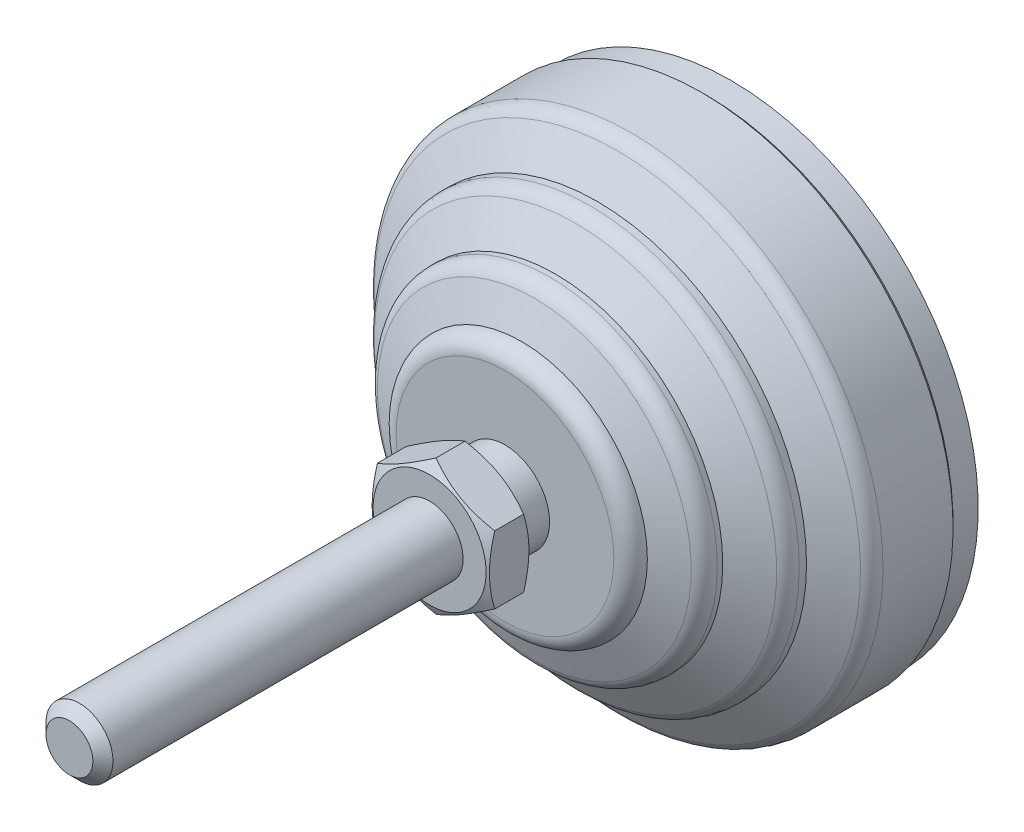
ISO-10303-21;
HEADER;
FILE_DESCRIPTION(('STEP AP214'),'2;1');
FILE_NAME('part.step','',(''),(''),'','','');
FILE_SCHEMA(('AUTOMOTIVE_DESIGN { 1 0 10303 214 1 1 1 1 }'));
ENDSEC;
DATA;
#1=APPLICATION_CONTEXT('core data for automotive mechanical design processes');
#2=APPLICATION_PROTOCOL_DEFINITION('international standard','automotive_design',2000,#1);
#3=PRODUCT_CONTEXT('',#1,'mechanical');
#4=PRODUCT('Part','Part','',(#3));
#5=PRODUCT_RELATED_PRODUCT_CATEGORY('part','',(#4));
#6=PRODUCT_DEFINITION_FORMATION('','',#4);
#7=PRODUCT_DEFINITION_CONTEXT('part definition',#1,'design');
#8=PRODUCT_DEFINITION('design','',#6,#7);
#9=PRODUCT_DEFINITION_SHAPE('','',#8);
#10=(LENGTH_UNIT() NAMED_UNIT(*) SI_UNIT(.MILLI.,.METRE.));
#11=(NAMED_UNIT(*) PLANE_ANGLE_UNIT() SI_UNIT($,.RADIAN.));
#12=(NAMED_UNIT(*) SI_UNIT($,.STERADIAN.) SOLID_ANGLE_UNIT());
#13=UNCERTAINTY_MEASURE_WITH_UNIT(LENGTH_MEASURE(1.E-05),#10,'distance_accuracy_value','');
#14=(GEOMETRIC_REPRESENTATION_CONTEXT(3) GLOBAL_UNCERTAINTY_ASSIGNED_CONTEXT((#13)) GLOBAL_UNIT_ASSIGNED_CONTEXT((#10,
#11,#12)) REPRESENTATION_CONTEXT('',''));
#15=CARTESIAN_POINT('',(0.,0.,0.));
#16=DIRECTION('',(0.,0.,1.));
#17=DIRECTION('',(1.,0.,0.));
#18=AXIS2_PLACEMENT_3D('',#15,#16,#17);
#19=CARTESIAN_POINT('',(-5.32445501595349,0.,31.));
#20=DIRECTION('',(0.,0.,1.));
#21=DIRECTION('',(0.,-1.,0.));
#22=AXIS2_PLACEMENT_3D('',#19,#20,#21);
#23=PLANE('',#22);
#24=CARTESIAN_POINT('',(0.,0.,31.));
#25=DIRECTION('',(0.,0.,-1.));
#26=DIRECTION('',(-1.,0.,0.));
#27=AXIS2_PLACEMENT_3D('',#24,#25,#26);
#28=CIRCLE('',#27,6.75);
#29=CARTESIAN_POINT('',(-6.75,0.,31.));
#30=VERTEX_POINT('',#29);
#31=EDGE_CURVE('E491',#30,#30,#28,.T.);
#32=ORIENTED_EDGE('',*,*,#31,.T.);
#33=EDGE_LOOP('',(#32));
#34=FACE_BOUND('',#33,.T.);
#35=CARTESIAN_POINT('',(0.,0.,31.));
#36=DIRECTION('',(0.,0.,-1.));
#37=DIRECTION('',(0.,1.,0.));
#38=AXIS2_PLACEMENT_3D('',#35,#36,#37);
#39=CIRCLE('',#38,5.32445501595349);
#40=CARTESIAN_POINT('',(0.,5.32445501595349,31.));
#41=VERTEX_POINT('',#40);
#42=EDGE_CURVE('E137',#41,#41,#39,.T.);
#43=ORIENTED_EDGE('',*,*,#42,.F.);
#44=EDGE_LOOP('',(#43));
#45=FACE_BOUND('',#44,.T.);
#46=ADVANCED_FACE('F14',(#34,#45),#23,.F.);
#47=CARTESIAN_POINT('',(0.,0.,0.));
#48=DIRECTION('',(0.,0.,-1.));
#49=DIRECTION('',(0.,1.,0.));
#50=AXIS2_PLACEMENT_3D('',#47,#48,#49);
#51=CYLINDRICAL_SURFACE('',#50,5.32445501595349);
#52=CARTESIAN_POINT('',(0.,0.,27.));
#53=DIRECTION('',(0.,0.,-1.));
#54=DIRECTION('',(0.,1.,0.));
#55=AXIS2_PLACEMENT_3D('',#52,#53,#54);
#56=CIRCLE('',#55,5.32445501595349);
#57=CARTESIAN_POINT('',(0.,5.32445501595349,27.));
#58=VERTEX_POINT('',#57);
#59=EDGE_CURVE('E134',#58,#58,#56,.T.);
#60=ORIENTED_EDGE('',*,*,#59,.F.);
#61=EDGE_LOOP('',(#60));
#62=FACE_BOUND('',#61,.T.);
#63=ORIENTED_EDGE('',*,*,#42,.T.);
#64=EDGE_LOOP('',(#63));
#65=FACE_BOUND('',#64,.T.);
#66=ADVANCED_FACE('F284',(#62,#65),#51,.T.);
#67=CARTESIAN_POINT('',(-13.,0.,27.));
#68=DIRECTION('',(0.,0.,-1.));
#69=DIRECTION('',(0.,1.,0.));
#70=AXIS2_PLACEMENT_3D('',#67,#68,#69);
#71=PLANE('',#70);
#72=CARTESIAN_POINT('',(0.,0.,27.));
#73=DIRECTION('',(0.,0.,-1.));
#74=DIRECTION('',(0.,1.,0.));
#75=AXIS2_PLACEMENT_3D('',#72,#73,#74);
#76=CIRCLE('',#75,13.);
#77=CARTESIAN_POINT('',(0.,13.,27.));
#78=VERTEX_POINT('',#77);
#79=EDGE_CURVE('E131',#78,#78,#76,.T.);
#80=ORIENTED_EDGE('',*,*,#79,.F.);
#81=EDGE_LOOP('',(#80));
#82=FACE_BOUND('',#81,.T.);
#83=ORIENTED_EDGE('',*,*,#59,.T.);
#84=EDGE_LOOP('',(#83));
#85=FACE_BOUND('',#84,.T.);
#86=ADVANCED_FACE('F280',(#82,#85),#71,.F.);
#87=CARTESIAN_POINT('',(0.,0.,25.));
#88=DIRECTION('',(0.,0.,-1.));
#89=DIRECTION('',(0.,1.,0.));
#90=AXIS2_PLACEMENT_3D('',#87,#88,#89);
#91=TOROIDAL_SURFACE('',#90,13.,2.);
#92=CARTESIAN_POINT('',(0.,0.,25.));
#93=DIRECTION('',(0.,0.,-1.));
#94=DIRECTION('',(0.,1.,0.));
#95=AXIS2_PLACEMENT_3D('',#92,#93,#94);
#96=CIRCLE('',#95,15.);
#97=CARTESIAN_POINT('',(0.,15.,25.));
#98=VERTEX_POINT('',#97);
#99=EDGE_CURVE('E128',#98,#98,#96,.T.);
#100=ORIENTED_EDGE('',*,*,#99,.F.);
#101=EDGE_LOOP('',(#100));
#102=FACE_BOUND('',#101,.T.);
#103=ORIENTED_EDGE('',*,*,#79,.T.);
#104=EDGE_LOOP('',(#103));
#105=FACE_BOUND('',#104,.T.);
#106=ADVANCED_FACE('F276',(#102,#105),#91,.T.);
#107=CARTESIAN_POINT('',(0.,0.,25.));
#108=DIRECTION('',(0.,0.,-1.));
#109=DIRECTION('',(0.,1.,0.));
#110=AXIS2_PLACEMENT_3D('',#107,#108,#109);
#111=CONICAL_SURFACE('',#110,15.,1.19028994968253);
#112=CARTESIAN_POINT('',(0.,0.,23.5028874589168));
#113=DIRECTION('',(0.,0.,-1.));
#114=DIRECTION('',(0.,1.,0.));
#115=AXIS2_PLACEMENT_3D('',#112,#113,#114);
#116=CIRCLE('',#115,18.7427813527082);
#117=CARTESIAN_POINT('',(0.,18.7427813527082,23.5028874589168));
#118=VERTEX_POINT('',#117);
#119=EDGE_CURVE('E125',#118,#118,#116,.T.);
#120=ORIENTED_EDGE('',*,*,#119,.F.);
#121=EDGE_LOOP('',(#120));
#122=FACE_BOUND('',#121,.T.);
#123=ORIENTED_EDGE('',*,*,#99,.T.);
#124=EDGE_LOOP('',(#123));
#125=FACE_BOUND('',#124,.T.);
#126=ADVANCED_FACE('F272',(#122,#125),#111,.T.);
#127=CARTESIAN_POINT('',(0.,0.,21.6459340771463));
#128=DIRECTION('',(0.,0.,-1.));
#129=DIRECTION('',(0.,1.,0.));
#130=AXIS2_PLACEMENT_3D('',#127,#128,#129);
#131=TOROIDAL_SURFACE('',#130,18.,2.);
#132=CARTESIAN_POINT('',(0.,0.,21.6459340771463));
#133=DIRECTION('',(0.,0.,-1.));
#134=DIRECTION('',(0.,1.,0.));
#135=AXIS2_PLACEMENT_3D('',#132,#133,#134);
#136=CIRCLE('',#135,20.);
#137=CARTESIAN_POINT('',(0.,20.,21.6459340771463));
#138=VERTEX_POINT('',#137);
#139=EDGE_CURVE('E122',#138,#138,#136,.T.);
#140=ORIENTED_EDGE('',*,*,#139,.F.);
#141=EDGE_LOOP('',(#140));
#142=FACE_BOUND('',#141,.T.);
#143=ORIENTED_EDGE('',*,*,#119,.T.);
#144=EDGE_LOOP('',(#143));
#145=FACE_BOUND('',#144,.T.);
#146=ADVANCED_FACE('F268',(#142,#145),#131,.T.);
#147=CARTESIAN_POINT('',(0.,0.,0.));
#148=DIRECTION('',(0.,0.,-1.));
#149=DIRECTION('',(0.,1.,0.));
#150=AXIS2_PLACEMENT_3D('',#147,#148,#149);
#151=CYLINDRICAL_SURFACE('',#150,20.);
#152=CARTESIAN_POINT('',(0.,0.,21.));
#153=DIRECTION('',(0.,0.,-1.));
#154=DIRECTION('',(0.,1.,0.));
#155=AXIS2_PLACEMENT_3D('',#152,#153,#154);
#156=CIRCLE('',#155,20.);
#157=CARTESIAN_POINT('',(0.,20.,21.));
#158=VERTEX_POINT('',#157);
#159=EDGE_CURVE('E119',#158,#158,#156,.T.);
#160=ORIENTED_EDGE('',*,*,#159,.F.);
#161=EDGE_LOOP('',(#160));
#162=FACE_BOUND('',#161,.T.);
#163=ORIENTED_EDGE('',*,*,#139,.T.);
#164=EDGE_LOOP('',(#163));
#165=FACE_BOUND('',#164,.T.);
#166=ADVANCED_FACE('F264',(#162,#165),#151,.T.);
#167=CARTESIAN_POINT('',(0.,0.,21.));
#168=DIRECTION('',(0.,0.,-1.));
#169=DIRECTION('',(0.,1.,0.));
#170=AXIS2_PLACEMENT_3D('',#167,#168,#169);
#171=CONICAL_SURFACE('',#170,20.,1.0303768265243);
#172=CARTESIAN_POINT('',(0.,0.,18.582605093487));
#173=DIRECTION('',(0.,0.,-1.));
#174=DIRECTION('',(0.,1.,0.));
#175=AXIS2_PLACEMENT_3D('',#172,#173,#174);
#176=CIRCLE('',#175,24.028991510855);
#177=CARTESIAN_POINT('',(0.,24.028991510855,18.582605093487));
#178=VERTEX_POINT('',#177);
#179=EDGE_CURVE('E116',#178,#178,#176,.T.);
#180=ORIENTED_EDGE('',*,*,#179,.F.);
#181=EDGE_LOOP('',(#180));
#182=FACE_BOUND('',#181,.T.);
#183=ORIENTED_EDGE('',*,*,#159,.T.);
#184=EDGE_LOOP('',(#183));
#185=FACE_BOUND('',#184,.T.);
#186=ADVANCED_FACE('F260',(#182,#185),#171,.T.);
#187=CARTESIAN_POINT('',(0.,0.,16.867619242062));
#188=DIRECTION('',(0.,0.,-1.));
#189=DIRECTION('',(0.,1.,0.));
#190=AXIS2_PLACEMENT_3D('',#187,#188,#189);
#191=TOROIDAL_SURFACE('',#190,23.,2.);
#192=CARTESIAN_POINT('',(0.,0.,16.867619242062));
#193=DIRECTION('',(0.,0.,-1.));
#194=DIRECTION('',(0.,1.,0.));
#195=AXIS2_PLACEMENT_3D('',#192,#193,#194);
#196=CIRCLE('',#195,25.);
#197=CARTESIAN_POINT('',(0.,25.,16.867619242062));
#198=VERTEX_POINT('',#197);
#199=EDGE_CURVE('E113',#198,#198,#196,.T.);
#200=ORIENTED_EDGE('',*,*,#199,.F.);
#201=EDGE_LOOP('',(#200));
#202=FACE_BOUND('',#201,.T.);
#203=ORIENTED_EDGE('',*,*,#179,.T.);
#204=EDGE_LOOP('',(#203));
#205=FACE_BOUND('',#204,.T.);
#206=ADVANCED_FACE('F256',(#202,#205),#191,.T.);
#207=CARTESIAN_POINT('',(0.,0.,0.));
#208=DIRECTION('',(0.,0.,-1.));
#209=DIRECTION('',(0.,1.,0.));
#210=AXIS2_PLACEMENT_3D('',#207,#208,#209);
#211=CYLINDRICAL_SURFACE('',#210,25.);
#212=CARTESIAN_POINT('',(0.,0.,16.));
#213=DIRECTION('',(0.,0.,-1.));
#214=DIRECTION('',(0.,1.,0.));
#215=AXIS2_PLACEMENT_3D('',#212,#213,#214);
#216=CIRCLE('',#215,25.);
#217=CARTESIAN_POINT('',(0.,25.,16.));
#218=VERTEX_POINT('',#217);
#219=EDGE_CURVE('E110',#218,#218,#216,.T.);
#220=ORIENTED_EDGE('',*,*,#219,.F.);
#221=EDGE_LOOP('',(#220));
#222=FACE_BOUND('',#221,.T.);
#223=ORIENTED_EDGE('',*,*,#199,.T.);
#224=EDGE_LOOP('',(#223));
#225=FACE_BOUND('',#224,.T.);
#226=ADVANCED_FACE('F252',(#222,#225),#211,.T.);
#227=CARTESIAN_POINT('',(0.,0.,16.));
#228=DIRECTION('',(0.,0.,-1.));
#229=DIRECTION('',(0.,1.,0.));
#230=AXIS2_PLACEMENT_3D('',#227,#228,#229);
#231=CONICAL_SURFACE('',#230,25.,1.03037682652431);
#232=CARTESIAN_POINT('',(0.,0.,13.582605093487));
#233=DIRECTION('',(0.,0.,-1.));
#234=DIRECTION('',(0.,1.,0.));
#235=AXIS2_PLACEMENT_3D('',#232,#233,#234);
#236=CIRCLE('',#235,29.0289915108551);
#237=CARTESIAN_POINT('',(0.,29.0289915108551,13.582605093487));
#238=VERTEX_POINT('',#237);
#239=EDGE_CURVE('E107',#238,#238,#236,.T.);
#240=ORIENTED_EDGE('',*,*,#239,.F.);
#241=EDGE_LOOP('',(#240));
#242=FACE_BOUND('',#241,.T.);
#243=ORIENTED_EDGE('',*,*,#219,.T.);
#244=EDGE_LOOP('',(#243));
#245=FACE_BOUND('',#244,.T.);
#246=ADVANCED_FACE('F248',(#242,#245),#231,.T.);
#247=CARTESIAN_POINT('',(0.,0.,11.8676192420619));
#248=DIRECTION('',(0.,0.,-1.));
#249=DIRECTION('',(0.,1.,0.));
#250=AXIS2_PLACEMENT_3D('',#247,#248,#249);
#251=TOROIDAL_SURFACE('',#250,28.,2.);
#252=CARTESIAN_POINT('',(0.,0.,11.8676192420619));
#253=DIRECTION('',(0.,0.,-1.));
#254=DIRECTION('',(0.,1.,0.));
#255=AXIS2_PLACEMENT_3D('',#252,#253,#254);
#256=CIRCLE('',#255,30.);
#257=CARTESIAN_POINT('',(0.,30.,11.8676192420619));
#258=VERTEX_POINT('',#257);
#259=EDGE_CURVE('E104',#258,#258,#256,.T.);
#260=ORIENTED_EDGE('',*,*,#259,.F.);
#261=EDGE_LOOP('',(#260));
#262=FACE_BOUND('',#261,.T.);
#263=ORIENTED_EDGE('',*,*,#239,.T.);
#264=EDGE_LOOP('',(#263));
#265=FACE_BOUND('',#264,.T.);
#266=ADVANCED_FACE('F244',(#262,#265),#251,.T.);
#267=CARTESIAN_POINT('',(0.,0.,0.));
#268=DIRECTION('',(0.,0.,-1.));
#269=DIRECTION('',(0.,1.,0.));
#270=AXIS2_PLACEMENT_3D('',#267,#268,#269);
#271=CYLINDRICAL_SURFACE('',#270,30.);
#272=CARTESIAN_POINT('',(0.,0.,3.50000000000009));
#273=DIRECTION('',(0.,0.,-1.));
#274=DIRECTION('',(0.,1.,0.));
#275=AXIS2_PLACEMENT_3D('',#272,#273,#274);
#276=CIRCLE('',#275,30.);
#277=CARTESIAN_POINT('',(0.,30.,3.50000000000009));
#278=VERTEX_POINT('',#277);
#279=EDGE_CURVE('E101',#278,#278,#276,.T.);
#280=ORIENTED_EDGE('',*,*,#279,.F.);
#281=EDGE_LOOP('',(#280));
#282=FACE_BOUND('',#281,.T.);
#283=ORIENTED_EDGE('',*,*,#259,.T.);
#284=EDGE_LOOP('',(#283));
#285=FACE_BOUND('',#284,.T.);
#286=ADVANCED_FACE('F240',(#282,#285),#271,.T.);
#287=CARTESIAN_POINT('',(0.,0.,3.50000000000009));
#288=DIRECTION('',(0.,0.,1.));
#289=DIRECTION('',(0.,-1.,0.));
#290=AXIS2_PLACEMENT_3D('',#287,#288,#289);
#291=CONICAL_SURFACE('',#290,30.,0.785398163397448);
#292=CARTESIAN_POINT('',(0.,0.,3.00000000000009));
#293=DIRECTION('',(0.,0.,-1.));
#294=DIRECTION('',(0.,1.,0.));
#295=AXIS2_PLACEMENT_3D('',#292,#293,#294);
#296=CIRCLE('',#295,29.5);
#297=CARTESIAN_POINT('',(0.,29.5,3.00000000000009));
#298=VERTEX_POINT('',#297);
#299=EDGE_CURVE('E98',#298,#298,#296,.T.);
#300=ORIENTED_EDGE('',*,*,#299,.F.);
#301=EDGE_LOOP('',(#300));
#302=FACE_BOUND('',#301,.T.);
#303=ORIENTED_EDGE('',*,*,#279,.T.);
#304=EDGE_LOOP('',(#303));
#305=FACE_BOUND('',#304,.T.);
#306=ADVANCED_FACE('F236',(#302,#305),#291,.T.);
#307=CARTESIAN_POINT('',(0.,0.,0.));
#308=DIRECTION('',(0.,0.,-1.));
#309=DIRECTION('',(0.,1.,0.));
#310=AXIS2_PLACEMENT_3D('',#307,#308,#309);
#311=CYLINDRICAL_SURFACE('',#310,29.5);
#312=CARTESIAN_POINT('',(0.,0.,0.));
#313=DIRECTION('',(0.,0.,-1.));
#314=DIRECTION('',(0.,1.,0.));
#315=AXIS2_PLACEMENT_3D('',#312,#313,#314);
#316=CIRCLE('',#315,29.5);
#317=CARTESIAN_POINT('',(0.,29.5,0.));
#318=VERTEX_POINT('',#317);
#319=EDGE_CURVE('E95',#318,#318,#316,.T.);
#320=ORIENTED_EDGE('',*,*,#319,.F.);
#321=EDGE_LOOP('',(#320));
#322=FACE_BOUND('',#321,.T.);
#323=ORIENTED_EDGE('',*,*,#299,.T.);
#324=EDGE_LOOP('',(#323));
#325=FACE_BOUND('',#324,.T.);
#326=ADVANCED_FACE('F232',(#322,#325),#311,.T.);
#327=CARTESIAN_POINT('',(-29.5,0.,0.));
#328=DIRECTION('',(0.,0.,1.));
#329=DIRECTION('',(0.,-1.,0.));
#330=AXIS2_PLACEMENT_3D('',#327,#328,#329);
#331=PLANE('',#330);
#332=ORIENTED_EDGE('',*,*,#319,.T.);
#333=EDGE_LOOP('',(#332));
#334=FACE_BOUND('',#333,.T.);
#335=ADVANCED_FACE('F228',(#334),#331,.F.);
#336=CARTESIAN_POINT('',(0.,0.,32.5154387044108));
#337=DIRECTION('',(0.,0.,1.));
#338=DIRECTION('',(1.,0.,0.));
#339=AXIS2_PLACEMENT_3D('',#336,#337,#338);
#340=CONICAL_SURFACE('',#339,9.37481683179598,1.0471975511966);
#341=CARTESIAN_POINT('',(0.256449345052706,-8.23096486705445,31.8573414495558));
#342=CARTESIAN_POINT('',(-0.070178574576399,-8.04238614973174,31.7426324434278));
#343=CARTESIAN_POINT('',(-0.39986120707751,-7.85204379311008,31.6376484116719));
#344=CARTESIAN_POINT('',(-1.06560452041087,-7.46767671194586,31.4533434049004));
#345=CARTESIAN_POINT('',(-1.40168205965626,-7.27364225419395,31.3741045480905));
#346=CARTESIAN_POINT('',(-1.90437933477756,-6.98340984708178,31.2806602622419));
#347=CARTESIAN_POINT('',(-2.06925183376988,-6.8882206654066,31.2539676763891));
#348=CARTESIAN_POINT('',(-2.39985958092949,-6.69734419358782,31.208932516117));
#349=CARTESIAN_POINT('',(-2.56559483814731,-6.6016568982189,31.1905900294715));
#350=CARTESIAN_POINT('',(-2.89735833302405,-6.41011315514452,31.1627784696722));
#351=CARTESIAN_POINT('',(-3.06338566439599,-6.3142572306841,31.1532951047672));
#352=CARTESIAN_POINT('',(-3.39564407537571,-6.12242774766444,31.1434217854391));
#353=CARTESIAN_POINT('',(-3.56187515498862,-6.02645418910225,31.1430318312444));
#354=CARTESIAN_POINT('',(-3.90456358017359,-5.82860293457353,31.1516196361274));
#355=CARTESIAN_POINT('',(-4.08100998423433,-5.72673155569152,31.1611850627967));
#356=CARTESIAN_POINT('',(-4.43328329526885,-5.52334646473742,31.1902895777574));
#357=CARTESIAN_POINT('',(-4.6091101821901,-5.42183276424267,31.2098289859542));
#358=CARTESIAN_POINT('',(-4.96011323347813,-5.21918105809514,31.2583312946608));
#359=CARTESIAN_POINT('',(-5.13528755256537,-5.11804411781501,31.2873118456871));
#360=CARTESIAN_POINT('',(-5.48440610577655,-4.91648042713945,31.3538922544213));
#361=CARTESIAN_POINT('',(-5.65835024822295,-4.81605372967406,31.3914927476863));
#362=CARTESIAN_POINT('',(-6.01037600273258,-4.61281156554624,31.4757380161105));
#363=CARTESIAN_POINT('',(-6.18841236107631,-4.51002222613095,31.5226332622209));
#364=CARTESIAN_POINT('',(-6.54295195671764,-4.30532869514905,31.6236460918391));
#365=CARTESIAN_POINT('',(-6.719455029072,-4.20342459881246,31.6777644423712));
#366=CARTESIAN_POINT('',(-7.07019454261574,-4.00092504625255,31.7920195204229));
#367=CARTESIAN_POINT('',(-7.24443734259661,-3.90032591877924,31.8521304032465));
#368=CARTESIAN_POINT('',(-7.59140443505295,-3.70000437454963,31.977694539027));
#369=CARTESIAN_POINT('',(-7.76412927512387,-3.60028164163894,32.043145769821));
#370=CARTESIAN_POINT('',(-7.93616468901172,-3.50095694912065,32.1108596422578));
#371=B_SPLINE_CURVE_WITH_KNOTS('',3,(#341,#342,#343,#344,#345,#346,#347,#348,#349,#350,#351,
#352,#353,#354,#355,#356,#357,#358,#359,#360,#361,#362,#363,#364,#365,#366,#367,#368,#369,#370),
.UNSPECIFIED.,.F.,.F.,(4,2,2,2,2,2,2,2,2,2,2,2,2,2,4),(0.,1.18339114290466,2.37052066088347,
2.94707331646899,3.52363203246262,4.09925901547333,4.67488601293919,5.28653018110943,
5.89819396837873,6.51100790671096,7.12386704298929,7.75629677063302,8.38879370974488,
9.01867200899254,9.64831289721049),.UNSPECIFIED.);
#372=CARTESIAN_POINT('',(0.,-8.08290376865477,31.7695523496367));
#373=VERTEX_POINT('',#372);
#374=CARTESIAN_POINT('',(-7.,-4.04145188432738,31.7695523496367));
#375=VERTEX_POINT('',#374);
#376=EDGE_CURVE('E73',#373,#375,#371,.T.);
#377=ORIENTED_EDGE('',*,*,#376,.T.);
#378=CARTESIAN_POINT('',(-7.,-10.8021871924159,34.5345128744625));
#379=CARTESIAN_POINT('',(-7.,-10.4968954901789,34.3866355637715));
#380=CARTESIAN_POINT('',(-7.,-10.1908971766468,34.2401917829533));
#381=CARTESIAN_POINT('',(-7.,-9.57711132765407,33.9509786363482));
#382=CARTESIAN_POINT('',(-7.,-9.26932351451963,33.8082098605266));
#383=CARTESIAN_POINT('',(-7.,-8.64997096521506,33.5264242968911));
#384=CARTESIAN_POINT('',(-7.,-8.33839475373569,33.3874326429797));
#385=CARTESIAN_POINT('',(-7.,-7.71274532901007,33.1152095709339));
#386=CARTESIAN_POINT('',(-7.,-7.39867223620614,32.9819778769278));
#387=CARTESIAN_POINT('',(-7.,-6.757603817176,32.7187213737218));
#388=CARTESIAN_POINT('',(-7.,-6.43051255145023,32.5889288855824));
#389=CARTESIAN_POINT('',(-7.,-5.77248430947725,32.3392976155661));
#390=CARTESIAN_POINT('',(-7.,-5.44154690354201,32.2194599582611));
#391=CARTESIAN_POINT('',(-7.,-4.77593283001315,31.9929240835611));
#392=CARTESIAN_POINT('',(-7.,-4.44126547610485,31.8861987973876));
#393=CARTESIAN_POINT('',(-7.,-3.76714288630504,31.6893460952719));
#394=CARTESIAN_POINT('',(-7.,-3.42768921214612,31.5992133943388));
#395=CARTESIAN_POINT('',(-7.,-2.74561647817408,31.4403887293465));
#396=CARTESIAN_POINT('',(-7.,-2.40302473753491,31.3715826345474));
#397=CARTESIAN_POINT('',(-7.,-1.88606077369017,31.2873743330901));
#398=CARTESIAN_POINT('',(-7.,-1.7132136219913,31.2624705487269));
#399=CARTESIAN_POINT('',(-7.,-1.36667855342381,31.2194862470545));
#400=CARTESIAN_POINT('',(-7.,-1.19299071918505,31.2014050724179));
#401=CARTESIAN_POINT('',(-7.,-0.847252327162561,31.1726502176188));
#402=CARTESIAN_POINT('',(-7.,-0.675209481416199,31.1618841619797));
#403=CARTESIAN_POINT('',(-7.,-0.330822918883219,31.1476332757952));
#404=CARTESIAN_POINT('',(-7.,-0.15847920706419,31.1441483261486));
#405=CARTESIAN_POINT('',(-7.,0.186201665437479,31.1445426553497));
#406=CARTESIAN_POINT('',(-7.,0.358538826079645,31.1484219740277));
#407=CARTESIAN_POINT('',(-7.,0.702898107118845,31.163450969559));
#408=CARTESIAN_POINT('',(-7.,0.874920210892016,31.174601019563));
#409=CARTESIAN_POINT('',(-7.,1.28998181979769,31.210041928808));
#410=CARTESIAN_POINT('',(-7.,1.53272519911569,31.2378735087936));
#411=CARTESIAN_POINT('',(-7.,2.01636344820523,31.3064834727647));
#412=CARTESIAN_POINT('',(-7.,2.25725805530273,31.3472636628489));
#413=CARTESIAN_POINT('',(-7.,2.97691961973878,31.4868607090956));
#414=CARTESIAN_POINT('',(-7.,3.45238604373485,31.6029071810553));
#415=CARTESIAN_POINT('',(-7.,4.16326623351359,31.8035513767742));
#416=CARTESIAN_POINT('',(-7.,4.40238203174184,31.8757821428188));
#417=CARTESIAN_POINT('',(-7.,4.87829017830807,32.0275984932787));
#418=CARTESIAN_POINT('',(-7.,5.11508251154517,32.1071841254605));
#419=CARTESIAN_POINT('',(-7.,5.58642109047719,32.2724455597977));
#420=CARTESIAN_POINT('',(-7.,5.82096808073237,32.3581192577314));
#421=CARTESIAN_POINT('',(-7.,6.2881287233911,32.5345635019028));
#422=CARTESIAN_POINT('',(-7.,6.52074239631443,32.6253339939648));
#423=CARTESIAN_POINT('',(-7.,7.06088786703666,32.8418405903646));
#424=CARTESIAN_POINT('',(-7.,7.36776176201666,32.9692148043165));
#425=CARTESIAN_POINT('',(-7.,7.97897578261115,33.229920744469));
#426=CARTESIAN_POINT('',(-7.,8.28331576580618,33.3632528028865));
#427=CARTESIAN_POINT('',(-7.,8.88991658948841,33.6347024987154));
#428=CARTESIAN_POINT('',(-7.,9.19217703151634,33.7728210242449));
#429=CARTESIAN_POINT('',(-7.,9.7949129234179,34.0529061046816));
#430=CARTESIAN_POINT('',(-7.,10.09538833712,34.1948727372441));
#431=CARTESIAN_POINT('',(-7.,10.6951369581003,34.4820877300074));
#432=CARTESIAN_POINT('',(-7.,10.9944086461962,34.6273392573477));
#433=CARTESIAN_POINT('',(-7.,11.5916796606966,34.9204374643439));
#434=CARTESIAN_POINT('',(-7.,11.8896789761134,35.0682841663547));
#435=CARTESIAN_POINT('',(-7.,12.7819930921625,35.5150027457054));
#436=CARTESIAN_POINT('',(-7.,13.3746985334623,35.8170890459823));
#437=CARTESIAN_POINT('',(-7.,14.5088645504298,36.4024970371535));
#438=CARTESIAN_POINT('',(-7.,15.0505705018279,36.6853454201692));
#439=CARTESIAN_POINT('',(-7.,16.1319627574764,37.2549167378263));
#440=CARTESIAN_POINT('',(-7.,16.6716489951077,37.5416397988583));
#441=CARTESIAN_POINT('',(-7.,17.7481638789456,38.1173637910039));
#442=CARTESIAN_POINT('',(-7.,18.2849962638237,38.4063577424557));
#443=CARTESIAN_POINT('',(-7.,19.3573645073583,38.9866753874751));
#444=CARTESIAN_POINT('',(-7.,19.8929004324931,39.2779989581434));
#445=CARTESIAN_POINT('',(-7.,20.427956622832,39.5701950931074));
#446=B_SPLINE_CURVE_WITH_KNOTS('',3,(#378,#379,#380,#381,#382,#383,#384,#385,#386,#387,#388,
#389,#390,#391,#392,#393,#394,#395,#396,#397,#398,#399,#400,#401,#402,#403,#404,#405,#406,#407,
#408,#409,#410,#411,#412,#413,#414,#415,#416,#417,#418,#419,#420,#421,#422,#423,#424,#425,#426,
#427,#428,#429,#430,#431,#432,#433,#434,#435,#436,#437,#438,#439,#440,#441,#442,#443,#444,#445),
.UNSPECIFIED.,.F.,.F.,(4,2,2,2,2,2,2,2,2,2,2,2,2,2,2,2,2,2,2,2,2,2,2,2,2,2,2,2,2,2,2,2,2,4),(0.,
1.01767496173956,2.03551228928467,3.05898196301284,4.08240256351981,5.13798188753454,
6.19368029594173,7.24716136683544,8.30030630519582,9.34771387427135,9.87149638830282,
10.3952284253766,10.9122173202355,11.4291977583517,11.9461809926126,12.4631907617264,
13.195776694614,13.9284648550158,15.3946761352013,16.1439771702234,16.8932830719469,
17.6423312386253,18.3913714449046,19.3880634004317,20.3848110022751,21.3817445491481,
22.378698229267,23.3766579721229,24.3746263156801,26.3703149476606,28.2036112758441,
30.0369675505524,31.8659935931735,33.694923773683),.UNSPECIFIED.);
#447=CARTESIAN_POINT('',(-7.,4.04145188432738,31.7695523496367));
#448=VERTEX_POINT('',#447);
#449=EDGE_CURVE('E81',#375,#448,#446,.T.);
#450=ORIENTED_EDGE('',*,*,#449,.T.);
#451=CARTESIAN_POINT('',(-12.686606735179,0.758287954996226,34.4405735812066));
#452=CARTESIAN_POINT('',(-12.4179213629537,0.913413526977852,34.291114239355));
#453=CARTESIAN_POINT('',(-12.1485822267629,1.06891654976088,34.1431919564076));
#454=CARTESIAN_POINT('',(-11.608235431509,1.38088591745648,33.8513177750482));
#455=CARTESIAN_POINT('',(-11.3372274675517,1.53735243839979,33.7073666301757));
#456=CARTESIAN_POINT('',(-10.7915651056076,1.85239074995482,33.4234942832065));
#457=CARTESIAN_POINT('',(-10.5168984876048,2.01096959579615,33.2836042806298));
#458=CARTESIAN_POINT('',(-9.9652279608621,2.32947672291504,33.0101360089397));
#459=CARTESIAN_POINT('',(-9.68822418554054,2.48940492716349,32.8765573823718));
#460=CARTESIAN_POINT('',(-9.12884703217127,2.81236147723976,32.6162403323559));
#461=CARTESIAN_POINT('',(-8.8464477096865,2.97540480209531,32.4895758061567));
#462=CARTESIAN_POINT('',(-8.27821462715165,3.30347432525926,32.2467603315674));
#463=CARTESIAN_POINT('',(-7.99238046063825,3.46850075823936,32.1306106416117));
#464=CARTESIAN_POINT('',(-7.41748363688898,3.80041759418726,31.9121840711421));
#465=CARTESIAN_POINT('',(-7.12843043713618,3.96730253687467,31.8098743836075));
#466=CARTESIAN_POINT('',(-6.54617671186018,4.30346688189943,31.6226787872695));
#467=CARTESIAN_POINT('',(-6.25297766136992,4.47274543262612,31.5377868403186));
#468=CARTESIAN_POINT('',(-5.66682384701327,4.81116149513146,31.3909917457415));
#469=CARTESIAN_POINT('',(-5.37393255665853,4.98026236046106,31.3287600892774));
#470=CARTESIAN_POINT('',(-4.93219343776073,5.2353005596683,31.2545019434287));
#471=CARTESIAN_POINT('',(-4.78452718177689,5.32055571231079,31.2329292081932));
#472=CARTESIAN_POINT('',(-4.48857364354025,5.49142456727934,31.1965744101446));
#473=CARTESIAN_POINT('',(-4.34028642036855,5.5770382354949,31.181791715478));
#474=CARTESIAN_POINT('',(-4.04413435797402,5.74802170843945,31.1594061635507));
#475=CARTESIAN_POINT('',(-3.89627176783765,5.83339021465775,31.1517637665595));
#476=CARTESIAN_POINT('',(-3.60039988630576,6.00421192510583,31.1436905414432));
#477=CARTESIAN_POINT('',(-3.4523905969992,6.08966512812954,31.143259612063));
#478=CARTESIAN_POINT('',(-3.15652557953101,6.26048287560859,31.1496193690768));
#479=CARTESIAN_POINT('',(-3.00866982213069,6.3458474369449,31.1564082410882));
#480=CARTESIAN_POINT('',(-2.71332605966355,6.51636423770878,31.1770468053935));
#481=CARTESIAN_POINT('',(-2.56583807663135,6.60151646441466,31.190896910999));
#482=CARTESIAN_POINT('',(-2.2018559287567,6.8116616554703,31.2335124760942));
#483=CARTESIAN_POINT('',(-1.98570298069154,6.93645761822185,31.2662338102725));
#484=CARTESIAN_POINT('',(-1.55522767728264,7.18499265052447,31.3449633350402));
#485=CARTESIAN_POINT('',(-1.3409056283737,7.30873154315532,31.3909737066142));
#486=CARTESIAN_POINT('',(-0.700242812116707,7.67861839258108,31.54661154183));
#487=CARTESIAN_POINT('',(-0.277059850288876,7.92294318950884,31.6737334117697));
#488=CARTESIAN_POINT('',(0.355593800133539,8.28820594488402,31.8909262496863));
#489=CARTESIAN_POINT('',(0.568408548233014,8.41107459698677,31.9687309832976));
#490=CARTESIAN_POINT('',(0.991983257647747,8.65562556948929,32.131602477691));
#491=CARTESIAN_POINT('',(1.20274304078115,8.77730778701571,32.2166698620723));
#492=CARTESIAN_POINT('',(1.62115049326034,9.01887544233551,32.3922822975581));
#493=CARTESIAN_POINT('',(1.82880909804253,9.13876719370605,32.4827929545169));
#494=CARTESIAN_POINT('',(2.24239181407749,9.37754928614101,32.6687333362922));
#495=CARTESIAN_POINT('',(2.44831647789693,9.49643994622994,32.7641614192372));
#496=CARTESIAN_POINT('',(2.65351624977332,9.61491208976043,32.8615800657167));
#497=B_SPLINE_CURVE_WITH_KNOTS('',3,(#451,#452,#453,#454,#455,#456,#457,#458,#459,#460,#461,
#462,#463,#464,#465,#466,#467,#468,#469,#470,#471,#472,#473,#474,#475,#476,#477,#478,#479,#480,
#481,#482,#483,#484,#485,#486,#487,#488,#489,#490,#491,#492,#493,#494,#495,#496),.UNSPECIFIED.,
.F.,.F.,(4,2,2,2,2,2,2,2,2,2,2,2,2,2,2,2,2,2,2,2,2,2,4),(0.,1.03313902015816,2.06647275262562,
3.10633371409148,4.14613571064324,5.19546598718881,6.24492168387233,7.29184439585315,
8.33840355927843,9.36912205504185,9.88461650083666,10.4000629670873,10.9126379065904,
11.4252056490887,11.9376446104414,12.4501135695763,13.2048625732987,13.9597355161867,
15.4724474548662,16.245675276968,17.0189695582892,17.7878072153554,18.556389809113),.UNSPECIFIED.);
#498=CARTESIAN_POINT('',(0.,8.08290376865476,31.7695523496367));
#499=VERTEX_POINT('',#498);
#500=EDGE_CURVE('E215',#448,#499,#497,.T.);
#501=ORIENTED_EDGE('',*,*,#500,.T.);
#502=CARTESIAN_POINT('',(-0.942881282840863,8.62727653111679,32.1135052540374));
#503=CARTESIAN_POINT('',(-0.770750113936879,8.52789655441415,32.0456869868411));
#504=CARTESIAN_POINT('',(-0.597929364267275,8.42811844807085,31.9801296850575));
#505=CARTESIAN_POINT('',(-0.25076954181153,8.2276856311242,31.854350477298));
#506=CARTESIAN_POINT('',(-0.0764299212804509,8.12703060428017,31.7941305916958));
#507=CARTESIAN_POINT('',(0.274506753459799,7.92441722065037,31.6796540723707));
#508=CARTESIAN_POINT('',(0.451110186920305,7.82245518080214,31.6254233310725));
#509=CARTESIAN_POINT('',(0.805852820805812,7.6176444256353,31.5241844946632));
#510=CARTESIAN_POINT('',(0.983991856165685,7.5147958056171,31.4771756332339));
#511=CARTESIAN_POINT('',(1.33621961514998,7.31143701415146,31.3927080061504));
#512=CARTESIAN_POINT('',(1.51026296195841,7.21095304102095,31.3549986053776));
#513=CARTESIAN_POINT('',(1.85958355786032,7.0092727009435,31.288202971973));
#514=CARTESIAN_POINT('',(2.03486071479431,6.90807638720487,31.2591161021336));
#515=CARTESIAN_POINT('',(2.38607300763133,6.70530387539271,31.2104069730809));
#516=CARTESIAN_POINT('',(2.56200628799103,6.60372874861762,31.1907670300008));
#517=CARTESIAN_POINT('',(2.91449663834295,6.4002183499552,31.1614703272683));
#518=CARTESIAN_POINT('',(3.09105368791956,6.29828308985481,31.151813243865));
#519=CARTESIAN_POINT('',(3.4337719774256,6.10041459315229,31.1430640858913));
#520=CARTESIAN_POINT('',(3.59992186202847,6.004487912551,31.1433733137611));
#521=CARTESIAN_POINT('',(3.93202143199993,5.81275013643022,31.1530775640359));
#522=CARTESIAN_POINT('',(4.09797111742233,5.71693904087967,31.1624725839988));
#523=CARTESIAN_POINT('',(4.429582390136,5.52548318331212,31.1901023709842));
#524=CARTESIAN_POINT('',(4.59524307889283,5.42983894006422,31.2083513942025));
#525=CARTESIAN_POINT('',(4.92570516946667,5.23904656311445,31.2531972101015));
#526=CARTESIAN_POINT('',(5.09050658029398,5.14389842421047,31.2797939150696));
#527=CARTESIAN_POINT('',(5.59298301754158,4.85379351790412,31.3729435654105));
#528=CARTESIAN_POINT('',(5.92891572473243,4.65984267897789,31.4519830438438));
#529=CARTESIAN_POINT('',(6.59438046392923,4.27563643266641,31.6359002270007));
#530=CARTESIAN_POINT('',(6.92392927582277,4.08537133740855,31.7406960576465));
#531=CARTESIAN_POINT('',(7.25042405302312,3.89686948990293,31.8552268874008));
#532=B_SPLINE_CURVE_WITH_KNOTS('',3,(#502,#503,#504,#505,#506,#507,#508,#509,#510,#511,#512,
#513,#514,#515,#516,#517,#518,#519,#520,#521,#522,#523,#524,#525,#526,#527,#528,#529,#530,#531),
.UNSPECIFIED.,.F.,.F.,(4,2,2,2,2,2,2,2,2,2,2,2,2,2,4),(0.,0.630055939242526,1.26034936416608,
1.89326901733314,2.52612146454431,3.13937859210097,3.75259038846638,4.36464979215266,
4.97668934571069,5.55203498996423,6.12738047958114,6.70365544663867,7.27992435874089,
8.46644185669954,9.64923536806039),.UNSPECIFIED.);
#533=CARTESIAN_POINT('',(7.,4.04145188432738,31.7695523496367));
#534=VERTEX_POINT('',#533);
#535=EDGE_CURVE('E481',#499,#534,#532,.T.);
#536=ORIENTED_EDGE('',*,*,#535,.T.);
#537=CARTESIAN_POINT('',(7.,-10.8021871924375,34.534512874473));
#538=CARTESIAN_POINT('',(7.,-10.4968954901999,34.3866355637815));
#539=CARTESIAN_POINT('',(7.,-10.190897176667,34.2401917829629));
#540=CARTESIAN_POINT('',(7.,-9.57711132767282,33.950978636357));
#541=CARTESIAN_POINT('',(7.,-9.26932351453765,33.8082098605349));
#542=CARTESIAN_POINT('',(7.,-8.6499709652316,33.5264242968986));
#543=CARTESIAN_POINT('',(7.,-8.33839475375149,33.3874326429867));
#544=CARTESIAN_POINT('',(7.,-7.7127453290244,33.11520957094));
#545=CARTESIAN_POINT('',(7.,-7.39867223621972,32.9819778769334));
#546=CARTESIAN_POINT('',(7.,-6.75760381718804,32.7187213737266));
#547=CARTESIAN_POINT('',(7.,-6.43051255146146,32.5889288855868));
#548=CARTESIAN_POINT('',(7.,-5.77248430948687,32.3392976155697));
#549=CARTESIAN_POINT('',(7.,-5.44154690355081,32.2194599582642));
#550=CARTESIAN_POINT('',(7.,-4.77593283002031,31.9929240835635));
#551=CARTESIAN_POINT('',(7.,-4.44126547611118,31.8861987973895));
#552=CARTESIAN_POINT('',(7.,-3.76714288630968,31.6893460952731));
#553=CARTESIAN_POINT('',(7.,-3.4276892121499,31.5992133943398));
#554=CARTESIAN_POINT('',(7.,-2.7456164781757,31.4403887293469));
#555=CARTESIAN_POINT('',(7.,-2.40302473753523,31.3715826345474));
#556=CARTESIAN_POINT('',(7.,-1.88606077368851,31.2873743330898));
#557=CARTESIAN_POINT('',(7.,-1.71321362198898,31.2624705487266));
#558=CARTESIAN_POINT('',(7.,-1.36667855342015,31.2194862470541));
#559=CARTESIAN_POINT('',(7.,-1.19299071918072,31.2014050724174));
#560=CARTESIAN_POINT('',(7.,-0.847252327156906,31.1726502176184));
#561=CARTESIAN_POINT('',(7.,-0.675209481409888,31.1618841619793));
#562=CARTESIAN_POINT('',(7.,-0.330822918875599,31.1476332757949));
#563=CARTESIAN_POINT('',(7.,-0.158479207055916,31.1441483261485));
#564=CARTESIAN_POINT('',(7.,0.186201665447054,31.1445426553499));
#565=CARTESIAN_POINT('',(7.,0.358538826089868,31.148421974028));
#566=CARTESIAN_POINT('',(7.,0.702898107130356,31.1634509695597));
#567=CARTESIAN_POINT('',(7.,0.874920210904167,31.1746010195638));
#568=CARTESIAN_POINT('',(7.,1.28998181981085,31.2100419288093));
#569=CARTESIAN_POINT('',(7.,1.53272519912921,31.2378735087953));
#570=CARTESIAN_POINT('',(7.,2.01636344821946,31.306483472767));
#571=CARTESIAN_POINT('',(7.,2.25725805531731,31.3472636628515));
#572=CARTESIAN_POINT('',(7.,2.97691961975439,31.4868607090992));
#573=CARTESIAN_POINT('',(7.,3.45238604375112,31.6029071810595));
#574=CARTESIAN_POINT('',(7.,4.16326623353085,31.8035513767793));
#575=CARTESIAN_POINT('',(7.,4.40238203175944,31.8757821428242));
#576=CARTESIAN_POINT('',(7.,4.87829017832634,32.0275984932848));
#577=CARTESIAN_POINT('',(7.,5.11508251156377,32.1071841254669));
#578=CARTESIAN_POINT('',(7.,5.58642109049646,32.2724455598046));
#579=CARTESIAN_POINT('',(7.,5.82096808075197,32.3581192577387));
#580=CARTESIAN_POINT('',(7.,6.28812872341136,32.5345635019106));
#581=CARTESIAN_POINT('',(7.,6.52074239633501,32.6253339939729));
#582=CARTESIAN_POINT('',(7.,7.06088786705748,32.8418405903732));
#583=CARTESIAN_POINT('',(7.,7.3677617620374,32.9692148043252));
#584=CARTESIAN_POINT('',(7.,7.97897578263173,33.2299207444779));
#585=CARTESIAN_POINT('',(7.,8.28331576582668,33.3632528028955));
#586=CARTESIAN_POINT('',(7.,8.88991658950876,33.6347024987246));
#587=CARTESIAN_POINT('',(7.,9.19217703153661,33.7728210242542));
#588=CARTESIAN_POINT('',(7.,9.79491292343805,34.0529061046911));
#589=CARTESIAN_POINT('',(7.,10.0953883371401,34.1948727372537));
#590=CARTESIAN_POINT('',(7.,10.6951369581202,34.482087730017));
#591=CARTESIAN_POINT('',(7.,10.9944086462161,34.6273392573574));
#592=CARTESIAN_POINT('',(7.,11.5916796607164,34.9204374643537));
#593=CARTESIAN_POINT('',(7.,11.8896789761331,35.0682841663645));
#594=CARTESIAN_POINT('',(7.,12.781993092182,35.5150027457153));
#595=CARTESIAN_POINT('',(7.,13.3746985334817,35.8170890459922));
#596=CARTESIAN_POINT('',(7.,14.5088645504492,36.4024970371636));
#597=CARTESIAN_POINT('',(7.,15.0505705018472,36.6853454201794));
#598=CARTESIAN_POINT('',(7.,16.1319627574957,37.2549167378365));
#599=CARTESIAN_POINT('',(7.,16.671648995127,37.5416397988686));
#600=CARTESIAN_POINT('',(7.,17.7481638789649,38.1173637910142));
#601=CARTESIAN_POINT('',(7.,18.2849962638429,38.4063577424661));
#602=CARTESIAN_POINT('',(7.,19.3573645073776,38.9866753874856));
#603=CARTESIAN_POINT('',(7.,19.8929004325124,39.2779989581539));
#604=CARTESIAN_POINT('',(7.,20.4279566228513,39.5701950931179));
#605=B_SPLINE_CURVE_WITH_KNOTS('',3,(#537,#538,#539,#540,#541,#542,#543,#544,#545,#546,#547,
#548,#549,#550,#551,#552,#553,#554,#555,#556,#557,#558,#559,#560,#561,#562,#563,#564,#565,#566,
#567,#568,#569,#570,#571,#572,#573,#574,#575,#576,#577,#578,#579,#580,#581,#582,#583,#584,#585,
#586,#587,#588,#589,#590,#591,#592,#593,#594,#595,#596,#597,#598,#599,#600,#601,#602,#603,#604),
.UNSPECIFIED.,.F.,.F.,(4,2,2,2,2,2,2,2,2,2,2,2,2,2,2,2,2,2,2,2,2,2,2,2,2,2,2,2,2,2,2,2,2,4),(0.,
1.01767496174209,2.03551228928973,3.05898196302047,4.08240256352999,5.13798188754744,
6.19368029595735,7.24716136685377,8.30030630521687,9.34771387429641,9.87149638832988,
10.3952284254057,10.9122173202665,11.4291977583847,11.9461809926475,12.4631907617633,
13.1957766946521,13.928464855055,15.3946761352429,16.1439771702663,16.893283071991,
17.6423312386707,18.3913714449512,19.3880634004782,20.3848110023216,21.3817445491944,
22.3786982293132,23.376657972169,24.3746263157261,26.3703149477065,28.20361127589,
30.0369675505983,31.8659935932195,33.694923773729),.UNSPECIFIED.);
#606=CARTESIAN_POINT('',(7.,-4.04145188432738,31.7695523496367));
#607=VERTEX_POINT('',#606);
#608=EDGE_CURVE('E34',#534,#607,#605,.F.);
#609=ORIENTED_EDGE('',*,*,#608,.T.);
#610=CARTESIAN_POINT('',(-5.69150946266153,-11.3688982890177,34.4433018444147));
#611=CARTESIAN_POINT('',(-5.42285588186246,-11.2137910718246,34.2938359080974));
#612=CARTESIAN_POINT('',(-5.15354935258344,-11.0583068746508,34.1459049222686));
#613=CARTESIAN_POINT('',(-4.61327002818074,-10.7463764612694,33.8540074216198));
#614=CARTESIAN_POINT('',(-4.34229692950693,-10.5899300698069,33.710041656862));
#615=CARTESIAN_POINT('',(-3.79671228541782,-10.2749366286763,33.4261348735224));
#616=CARTESIAN_POINT('',(-3.52208857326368,-10.1163825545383,33.2862249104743));
#617=CARTESIAN_POINT('',(-2.97050705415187,-9.79792681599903,33.0127058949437));
#618=CARTESIAN_POINT('',(-2.69354938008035,-9.63802522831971,32.8790964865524));
#619=CARTESIAN_POINT('',(-2.13423510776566,-9.31510498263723,32.6186874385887));
#620=CARTESIAN_POINT('',(-1.8518522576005,-9.15207116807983,32.4919625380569));
#621=CARTESIAN_POINT('',(-1.28365554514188,-8.82402264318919,32.2490094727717));
#622=CARTESIAN_POINT('',(-0.99784127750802,-8.65900769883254,32.1327825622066));
#623=CARTESIAN_POINT('',(-0.422984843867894,-8.32711418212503,31.9141791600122));
#624=CARTESIAN_POINT('',(-0.133952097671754,-8.16024104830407,31.8117700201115));
#625=CARTESIAN_POINT('',(0.448259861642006,-7.82410081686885,31.6243493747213));
#626=CARTESIAN_POINT('',(0.741437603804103,-7.65483456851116,31.5393318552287));
#627=CARTESIAN_POINT('',(1.32764160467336,-7.31638953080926,31.3922367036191));
#628=CARTESIAN_POINT('',(1.62060561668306,-7.14724667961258,31.3298375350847));
#629=CARTESIAN_POINT('',(2.06246086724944,-6.89214143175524,31.2553229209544));
#630=CARTESIAN_POINT('',(2.21016695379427,-6.80686328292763,31.2336638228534));
#631=CARTESIAN_POINT('',(2.50620293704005,-6.63594682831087,31.197136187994));
#632=CARTESIAN_POINT('',(2.65453277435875,-6.55030855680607,31.1822670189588));
#633=CARTESIAN_POINT('',(2.95076865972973,-6.3792766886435,31.1597110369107));
#634=CARTESIAN_POINT('',(3.09867243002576,-6.29388440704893,31.1519844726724));
#635=CARTESIAN_POINT('',(3.3946297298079,-6.12301338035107,31.143746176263));
#636=CARTESIAN_POINT('',(3.54268325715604,-6.03753463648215,31.1432343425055));
#637=CARTESIAN_POINT('',(3.838639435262,-5.86666425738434,31.1494374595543));
#638=CARTESIAN_POINT('',(3.98654211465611,-5.78127260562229,31.1561505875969));
#639=CARTESIAN_POINT('',(4.28198207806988,-5.61070026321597,31.1766443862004));
#640=CARTESIAN_POINT('',(4.42951934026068,-5.52551958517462,31.190425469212));
#641=CARTESIAN_POINT('',(4.79337905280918,-5.31544508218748,31.2328513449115));
#642=CARTESIAN_POINT('',(5.00936274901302,-5.19074683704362,31.265439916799));
#643=CARTESIAN_POINT('',(5.43950583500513,-4.94240361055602,31.3438940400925));
#644=CARTESIAN_POINT('',(5.65366492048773,-4.81875880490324,31.3897617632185));
#645=CARTESIAN_POINT('',(6.29384541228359,-4.44915042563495,31.5449647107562));
#646=CARTESIAN_POINT('',(6.71671684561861,-4.20500548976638,31.6717880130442));
#647=CARTESIAN_POINT('',(7.34891843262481,-3.84000373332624,31.8885392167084));
#648=CARTESIAN_POINT('',(7.5615889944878,-3.71721832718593,31.9661986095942));
#649=CARTESIAN_POINT('',(7.98487660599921,-3.47283311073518,32.128782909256));
#650=CARTESIAN_POINT('',(8.19549347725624,-3.35123340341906,32.2137084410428));
#651=CARTESIAN_POINT('',(8.61361728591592,-3.1098295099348,32.3890422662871));
#652=CARTESIAN_POINT('',(8.82113514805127,-2.9900190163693,32.4794161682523));
#653=CARTESIAN_POINT('',(9.23443633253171,-2.75139946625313,32.6650868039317));
#654=CARTESIAN_POINT('',(9.44022020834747,-2.63259009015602,32.760381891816));
#655=CARTESIAN_POINT('',(9.64527898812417,-2.51419934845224,32.8576693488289));
#656=B_SPLINE_CURVE_WITH_KNOTS('',3,(#610,#611,#612,#613,#614,#615,#616,#617,#618,#619,#620,
#621,#622,#623,#624,#625,#626,#627,#628,#629,#630,#631,#632,#633,#634,#635,#636,#637,#638,#639,
#640,#641,#642,#643,#644,#645,#646,#647,#648,#649,#650,#651,#652,#653,#654,#655),.UNSPECIFIED.,
.F.,.F.,(4,2,2,2,2,2,2,2,2,2,2,2,2,2,2,2,2,2,2,2,2,2,4),(0.,1.0330483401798,2.06629076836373,
3.10604008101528,4.1457305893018,5.19507369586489,6.24454200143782,7.29148552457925,
8.33806640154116,9.3691246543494,9.88478860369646,10.4004045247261,10.9131332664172,
11.4258547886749,11.938446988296,12.4510691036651,13.205185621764,13.9594255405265,
15.4708668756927,16.2434867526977,17.016173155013,17.7844097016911,18.5523909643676),.UNSPECIFIED.);
#657=EDGE_CURVE('E9',#607,#373,#656,.F.);
#658=ORIENTED_EDGE('',*,*,#657,.T.);
#659=EDGE_LOOP('',(#377,#450,#501,#536,#609,#658));
#660=FACE_BOUND('',#659,.T.);
#661=ORIENTED_EDGE('',*,*,#31,.F.);
#662=EDGE_LOOP('',(#661));
#663=FACE_BOUND('',#662,.T.);
#664=ADVANCED_FACE('F71',(#660,#663),#340,.T.);
#665=CARTESIAN_POINT('',(-2.62445501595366,0.,79.));
#666=DIRECTION('',(0.,0.,-1.));
#667=DIRECTION('',(0.,1.,0.));
#668=AXIS2_PLACEMENT_3D('',#665,#666,#667);
#669=PLANE('',#668);
#670=CARTESIAN_POINT('',(0.,0.,79.));
#671=DIRECTION('',(0.,0.,-1.));
#672=DIRECTION('',(0.,1.,0.));
#673=AXIS2_PLACEMENT_3D('',#670,#671,#672);
#674=CIRCLE('',#673,2.8);
#675=CARTESIAN_POINT('',(0.,2.8,79.));
#676=VERTEX_POINT('',#675);
#677=EDGE_CURVE('E143',#676,#676,#674,.F.);
#678=ORIENTED_EDGE('',*,*,#677,.T.);
#679=EDGE_LOOP('',(#678));
#680=FACE_BOUND('',#679,.T.);
#681=ADVANCED_FACE('F294',(#680),#669,.F.);
#682=CARTESIAN_POINT('',(0.,0.,79.));
#683=DIRECTION('',(0.,0.,-1.));
#684=DIRECTION('',(0.,1.,0.));
#685=AXIS2_PLACEMENT_3D('',#682,#683,#684);
#686=CONICAL_SURFACE('',#685,2.8,0.785398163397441);
#687=CARTESIAN_POINT('',(0.,0.,77.8));
#688=DIRECTION('',(0.,0.,-1.));
#689=DIRECTION('',(0.,1.,0.));
#690=AXIS2_PLACEMENT_3D('',#687,#688,#689);
#691=CIRCLE('',#690,4.);
#692=CARTESIAN_POINT('',(0.,4.,77.8));
#693=VERTEX_POINT('',#692);
#694=EDGE_CURVE('E146',#693,#693,#691,.T.);
#695=ORIENTED_EDGE('',*,*,#694,.F.);
#696=EDGE_LOOP('',(#695));
#697=FACE_BOUND('',#696,.T.);
#698=ORIENTED_EDGE('',*,*,#677,.F.);
#699=EDGE_LOOP('',(#698));
#700=FACE_BOUND('',#699,.T.);
#701=ADVANCED_FACE('F16',(#697,#700),#686,.T.);
#702=CARTESIAN_POINT('',(0.,0.,79.));
#703=DIRECTION('',(0.,0.,-1.));
#704=DIRECTION('',(0.,1.,0.));
#705=AXIS2_PLACEMENT_3D('',#702,#703,#704);
#706=CYLINDRICAL_SURFACE('',#705,4.);
#707=ORIENTED_EDGE('',*,*,#694,.T.);
#708=EDGE_LOOP('',(#707));
#709=FACE_BOUND('',#708,.T.);
#710=CARTESIAN_POINT('',(0.,0.,36.));
#711=DIRECTION('',(0.,0.,-1.));
#712=DIRECTION('',(0.,1.,0.));
#713=AXIS2_PLACEMENT_3D('',#710,#711,#712);
#714=CIRCLE('',#713,4.);
#715=CARTESIAN_POINT('',(0.,4.,36.));
#716=VERTEX_POINT('',#715);
#717=EDGE_CURVE('E140',#716,#716,#714,.F.);
#718=ORIENTED_EDGE('',*,*,#717,.T.);
#719=EDGE_LOOP('',(#718));
#720=FACE_BOUND('',#719,.T.);
#721=ADVANCED_FACE('F163',(#709,#720),#706,.T.);
#722=CARTESIAN_POINT('',(-3.82445501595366,0.,36.));
#723=DIRECTION('',(0.,0.,-1.));
#724=DIRECTION('',(0.,1.,0.));
#725=AXIS2_PLACEMENT_3D('',#722,#723,#724);
#726=PLANE('',#725);
#727=CARTESIAN_POINT('',(0.,0.,36.));
#728=DIRECTION('',(0.,0.,-1.));
#729=DIRECTION('',(-1.,0.,0.));
#730=AXIS2_PLACEMENT_3D('',#727,#728,#729);
#731=CIRCLE('',#730,6.75);
#732=CARTESIAN_POINT('',(-6.75,0.,36.));
#733=VERTEX_POINT('',#732);
#734=EDGE_CURVE('E80',#733,#733,#731,.T.);
#735=ORIENTED_EDGE('',*,*,#734,.F.);
#736=EDGE_LOOP('',(#735));
#737=FACE_BOUND('',#736,.T.);
#738=ORIENTED_EDGE('',*,*,#717,.F.);
#739=EDGE_LOOP('',(#738));
#740=FACE_BOUND('',#739,.T.);
#741=ADVANCED_FACE('F160',(#737,#740),#726,.F.);
#742=CARTESIAN_POINT('',(0.,0.,36.));
#743=DIRECTION('',(0.,0.,-1.));
#744=DIRECTION('',(-1.,0.,0.));
#745=AXIS2_PLACEMENT_3D('',#742,#743,#744);
#746=CONICAL_SURFACE('',#745,6.75,1.0471975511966);
#747=CARTESIAN_POINT('',(-7.93616468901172,-3.50095694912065,34.8891403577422));
#748=CARTESIAN_POINT('',(-7.76412927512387,-3.60028164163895,34.956854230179));
#749=CARTESIAN_POINT('',(-7.59140443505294,-3.70000437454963,35.022305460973));
#750=CARTESIAN_POINT('',(-7.2444373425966,-3.90032591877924,35.1478695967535));
#751=CARTESIAN_POINT('',(-7.07019454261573,-4.00092504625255,35.2079804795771));
#752=CARTESIAN_POINT('',(-6.71945502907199,-4.20342459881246,35.3222355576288));
#753=CARTESIAN_POINT('',(-6.54295195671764,-4.30532869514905,35.3763539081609));
#754=CARTESIAN_POINT('',(-6.18841236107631,-4.51002222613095,35.4773667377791));
#755=CARTESIAN_POINT('',(-6.01037600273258,-4.61281156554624,35.5242619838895));
#756=CARTESIAN_POINT('',(-5.65835024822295,-4.81605372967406,35.6085072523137));
#757=CARTESIAN_POINT('',(-5.48440610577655,-4.91648042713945,35.6461077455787));
#758=CARTESIAN_POINT('',(-5.13528755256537,-5.11804411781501,35.7126881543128));
#759=CARTESIAN_POINT('',(-4.96011323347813,-5.21918105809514,35.7416687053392));
#760=CARTESIAN_POINT('',(-4.60911018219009,-5.42183276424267,35.7901710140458));
#761=CARTESIAN_POINT('',(-4.43328329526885,-5.52334646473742,35.8097104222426));
#762=CARTESIAN_POINT('',(-4.08100998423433,-5.72673155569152,35.8388149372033));
#763=CARTESIAN_POINT('',(-3.90456358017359,-5.82860293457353,35.8483803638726));
#764=CARTESIAN_POINT('',(-3.56187515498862,-6.02645418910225,35.8569681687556));
#765=CARTESIAN_POINT('',(-3.39564407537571,-6.12242774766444,35.8565782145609));
#766=CARTESIAN_POINT('',(-3.06338566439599,-6.3142572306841,35.8467048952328));
#767=CARTESIAN_POINT('',(-2.89735833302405,-6.41011315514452,35.8372215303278));
#768=CARTESIAN_POINT('',(-2.56559483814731,-6.6016568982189,35.8094099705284));
#769=CARTESIAN_POINT('',(-2.39985958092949,-6.69734419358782,35.7910674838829));
#770=CARTESIAN_POINT('',(-2.06925183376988,-6.8882206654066,35.7460323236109));
#771=CARTESIAN_POINT('',(-1.90437933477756,-6.98340984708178,35.7193397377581));
#772=CARTESIAN_POINT('',(-1.40168205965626,-7.27364225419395,35.6258954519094));
#773=CARTESIAN_POINT('',(-1.06560452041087,-7.46767671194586,35.5466565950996));
#774=CARTESIAN_POINT('',(-0.399861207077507,-7.85204379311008,35.3623515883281));
#775=CARTESIAN_POINT('',(-0.0701785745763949,-8.04238614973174,35.2573675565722));
#776=CARTESIAN_POINT('',(0.25644934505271,-8.23096486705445,35.1426585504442));
#777=B_SPLINE_CURVE_WITH_KNOTS('',3,(#747,#748,#749,#750,#751,#752,#753,#754,#755,#756,#757,
#758,#759,#760,#761,#762,#763,#764,#765,#766,#767,#768,#769,#770,#771,#772,#773,#774,#775,#776),
.UNSPECIFIED.,.F.,.F.,(4,2,2,2,2,2,2,2,2,2,2,2,2,2,4),(0.,0.629640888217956,1.25951918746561,
1.89201612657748,2.5244458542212,3.13730499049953,3.75011892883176,4.36178271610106,
4.97342688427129,5.54905388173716,6.12468086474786,6.7012395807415,7.27779223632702,
8.46492175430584,9.64831289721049),.UNSPECIFIED.);
#778=CARTESIAN_POINT('',(-7.,-4.04145188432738,35.2304476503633));
#779=VERTEX_POINT('',#778);
#780=CARTESIAN_POINT('',(0.,-8.08290376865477,35.2304476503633));
#781=VERTEX_POINT('',#780);
#782=EDGE_CURVE('E87',#779,#781,#777,.T.);
#783=ORIENTED_EDGE('',*,*,#782,.T.);
#784=CARTESIAN_POINT('',(-5.69150946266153,-11.3688982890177,32.5566981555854));
#785=CARTESIAN_POINT('',(-5.42285588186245,-11.2137910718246,32.7061640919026));
#786=CARTESIAN_POINT('',(-5.15354935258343,-11.0583068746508,32.8540950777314));
#787=CARTESIAN_POINT('',(-4.61327002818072,-10.7463764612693,33.1459925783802));
#788=CARTESIAN_POINT('',(-4.34229692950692,-10.5899300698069,33.289958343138));
#789=CARTESIAN_POINT('',(-3.79671228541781,-10.2749366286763,33.5738651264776));
#790=CARTESIAN_POINT('',(-3.52208857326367,-10.1163825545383,33.7137750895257));
#791=CARTESIAN_POINT('',(-2.97050705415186,-9.79792681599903,33.9872941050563));
#792=CARTESIAN_POINT('',(-2.69354938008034,-9.6380252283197,34.1209035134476));
#793=CARTESIAN_POINT('',(-2.13423510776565,-9.31510498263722,34.3813125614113));
#794=CARTESIAN_POINT('',(-1.85185225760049,-9.15207116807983,34.5080374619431));
#795=CARTESIAN_POINT('',(-1.28365554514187,-8.82402264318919,34.7509905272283));
#796=CARTESIAN_POINT('',(-0.997841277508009,-8.65900769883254,34.8672174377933));
#797=CARTESIAN_POINT('',(-0.422984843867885,-8.32711418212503,35.0858208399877));
#798=CARTESIAN_POINT('',(-0.133952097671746,-8.16024104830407,35.1882299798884));
#799=CARTESIAN_POINT('',(0.448259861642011,-7.82410081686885,35.3756506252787));
#800=CARTESIAN_POINT('',(0.741437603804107,-7.65483456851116,35.4606681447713));
#801=CARTESIAN_POINT('',(1.32764160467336,-7.31638953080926,35.6077632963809));
#802=CARTESIAN_POINT('',(1.62060561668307,-7.14724667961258,35.6701624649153));
#803=CARTESIAN_POINT('',(2.06246086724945,-6.89214143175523,35.7446770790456));
#804=CARTESIAN_POINT('',(2.21016695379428,-6.80686328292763,35.7663361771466));
#805=CARTESIAN_POINT('',(2.50620293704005,-6.63594682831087,35.802863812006));
#806=CARTESIAN_POINT('',(2.65453277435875,-6.55030855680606,35.8177329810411));
#807=CARTESIAN_POINT('',(2.95076865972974,-6.3792766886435,35.8402889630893));
#808=CARTESIAN_POINT('',(3.09867243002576,-6.29388440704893,35.8480155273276));
#809=CARTESIAN_POINT('',(3.39462972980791,-6.12301338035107,35.856253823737));
#810=CARTESIAN_POINT('',(3.54268325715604,-6.03753463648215,35.8567656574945));
#811=CARTESIAN_POINT('',(3.838639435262,-5.86666425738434,35.8505625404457));
#812=CARTESIAN_POINT('',(3.98654211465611,-5.78127260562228,35.843849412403));
#813=CARTESIAN_POINT('',(4.28198207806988,-5.61070026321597,35.8233556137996));
#814=CARTESIAN_POINT('',(4.42951934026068,-5.52551958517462,35.809574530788));
#815=CARTESIAN_POINT('',(4.79337905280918,-5.31544508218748,35.7671486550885));
#816=CARTESIAN_POINT('',(5.00936274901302,-5.19074683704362,35.7345600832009));
#817=CARTESIAN_POINT('',(5.43950583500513,-4.94240361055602,35.6561059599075));
#818=CARTESIAN_POINT('',(5.65366492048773,-4.81875880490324,35.6102382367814));
#819=CARTESIAN_POINT('',(6.29384541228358,-4.44915042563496,35.4550352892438));
#820=CARTESIAN_POINT('',(6.7167168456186,-4.20500548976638,35.3282119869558));
#821=CARTESIAN_POINT('',(7.3489184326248,-3.84000373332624,35.1114607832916));
#822=CARTESIAN_POINT('',(7.5615889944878,-3.71721832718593,35.0338013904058));
#823=CARTESIAN_POINT('',(7.98487660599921,-3.47283311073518,34.871217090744));
#824=CARTESIAN_POINT('',(8.19549347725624,-3.35123340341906,34.7862915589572));
#825=CARTESIAN_POINT('',(8.61361728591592,-3.1098295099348,34.6109577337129));
#826=CARTESIAN_POINT('',(8.82113514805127,-2.9900190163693,34.5205838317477));
#827=CARTESIAN_POINT('',(9.2344363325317,-2.75139946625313,34.3349131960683));
#828=CARTESIAN_POINT('',(9.44022020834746,-2.63259009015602,34.239618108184));
#829=CARTESIAN_POINT('',(9.64527898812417,-2.51419934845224,34.1423306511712));
#830=B_SPLINE_CURVE_WITH_KNOTS('',3,(#784,#785,#786,#787,#788,#789,#790,#791,#792,#793,#794,
#795,#796,#797,#798,#799,#800,#801,#802,#803,#804,#805,#806,#807,#808,#809,#810,#811,#812,#813,
#814,#815,#816,#817,#818,#819,#820,#821,#822,#823,#824,#825,#826,#827,#828,#829),.UNSPECIFIED.,
.F.,.F.,(4,2,2,2,2,2,2,2,2,2,2,2,2,2,2,2,2,2,2,2,2,2,4),(0.,1.03304834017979,2.06629076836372,
3.10604008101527,4.14573058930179,5.19507369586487,6.2445420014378,7.29148552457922,
8.33806640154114,9.36912465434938,9.88478860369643,10.4004045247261,10.9131332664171,
11.4258547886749,11.938446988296,12.4510691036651,13.2051856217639,13.9594255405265,
15.4708668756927,16.2434867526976,17.016173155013,17.784409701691,18.5523909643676),.UNSPECIFIED.);
#831=CARTESIAN_POINT('',(7.,-4.04145188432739,35.2304476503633));
#832=VERTEX_POINT('',#831);
#833=EDGE_CURVE('E28',#781,#832,#830,.T.);
#834=ORIENTED_EDGE('',*,*,#833,.T.);
#835=CARTESIAN_POINT('',(7.,-10.8021871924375,32.465487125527));
#836=CARTESIAN_POINT('',(7.,-10.4968954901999,32.6133644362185));
#837=CARTESIAN_POINT('',(7.,-10.190897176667,32.759808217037));
#838=CARTESIAN_POINT('',(7.,-9.57711132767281,33.049021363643));
#839=CARTESIAN_POINT('',(7.,-9.26932351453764,33.1917901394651));
#840=CARTESIAN_POINT('',(7.,-8.6499709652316,33.4735757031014));
#841=CARTESIAN_POINT('',(7.,-8.33839475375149,33.6125673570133));
#842=CARTESIAN_POINT('',(7.,-7.71274532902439,33.88479042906));
#843=CARTESIAN_POINT('',(7.,-7.39867223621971,34.0180221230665));
#844=CARTESIAN_POINT('',(7.,-6.75760381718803,34.2812786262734));
#845=CARTESIAN_POINT('',(7.,-6.43051255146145,34.4110711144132));
#846=CARTESIAN_POINT('',(7.,-5.77248430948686,34.6607023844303));
#847=CARTESIAN_POINT('',(7.,-5.4415469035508,34.7805400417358));
#848=CARTESIAN_POINT('',(7.,-4.77593283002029,35.0070759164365));
#849=CARTESIAN_POINT('',(7.,-4.44126547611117,35.1138012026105));
#850=CARTESIAN_POINT('',(7.,-3.76714288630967,35.3106539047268));
#851=CARTESIAN_POINT('',(7.,-3.4276892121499,35.4007866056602));
#852=CARTESIAN_POINT('',(7.,-2.7456164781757,35.5596112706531));
#853=CARTESIAN_POINT('',(7.,-2.40302473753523,35.6284173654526));
#854=CARTESIAN_POINT('',(7.,-1.88606077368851,35.7126256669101));
#855=CARTESIAN_POINT('',(7.,-1.71321362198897,35.7375294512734));
#856=CARTESIAN_POINT('',(7.,-1.36667855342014,35.7805137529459));
#857=CARTESIAN_POINT('',(7.,-1.19299071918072,35.7985949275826));
#858=CARTESIAN_POINT('',(7.,-0.847252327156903,35.8273497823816));
#859=CARTESIAN_POINT('',(7.,-0.675209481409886,35.8381158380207));
#860=CARTESIAN_POINT('',(7.,-0.330822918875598,35.852366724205));
#861=CARTESIAN_POINT('',(7.,-0.158479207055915,35.8558516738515));
#862=CARTESIAN_POINT('',(7.,0.186201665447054,35.8554573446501));
#863=CARTESIAN_POINT('',(7.,0.358538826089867,35.851578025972));
#864=CARTESIAN_POINT('',(7.,0.702898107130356,35.8365490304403));
#865=CARTESIAN_POINT('',(7.,0.874920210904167,35.8253989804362));
#866=CARTESIAN_POINT('',(7.,1.28998181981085,35.7899580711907));
#867=CARTESIAN_POINT('',(7.,1.5327251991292,35.7621264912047));
#868=CARTESIAN_POINT('',(7.,2.01636344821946,35.693516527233));
#869=CARTESIAN_POINT('',(7.,2.25725805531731,35.6527363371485));
#870=CARTESIAN_POINT('',(7.,2.97691961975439,35.5131392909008));
#871=CARTESIAN_POINT('',(7.,3.45238604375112,35.3970928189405));
#872=CARTESIAN_POINT('',(7.,4.16326623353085,35.1964486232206));
#873=CARTESIAN_POINT('',(7.,4.40238203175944,35.1242178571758));
#874=CARTESIAN_POINT('',(7.,4.87829017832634,34.9724015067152));
#875=CARTESIAN_POINT('',(7.,5.11508251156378,34.8928158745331));
#876=CARTESIAN_POINT('',(7.,5.58642109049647,34.7275544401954));
#877=CARTESIAN_POINT('',(7.,5.82096808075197,34.6418807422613));
#878=CARTESIAN_POINT('',(7.,6.28812872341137,34.4654364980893));
#879=CARTESIAN_POINT('',(7.,6.52074239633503,34.3746660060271));
#880=CARTESIAN_POINT('',(7.,7.06088786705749,34.1581594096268));
#881=CARTESIAN_POINT('',(7.,7.36776176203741,34.0307851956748));
#882=CARTESIAN_POINT('',(7.,7.97897578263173,33.770079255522));
#883=CARTESIAN_POINT('',(7.,8.28331576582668,33.6367471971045));
#884=CARTESIAN_POINT('',(7.,8.88991658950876,33.3652975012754));
#885=CARTESIAN_POINT('',(7.,9.19217703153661,33.2271789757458));
#886=CARTESIAN_POINT('',(7.,9.79491292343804,32.9470938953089));
#887=CARTESIAN_POINT('',(7.,10.0953883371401,32.8051272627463));
#888=CARTESIAN_POINT('',(7.,10.6951369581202,32.517912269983));
#889=CARTESIAN_POINT('',(7.,10.9944086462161,32.3726607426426));
#890=CARTESIAN_POINT('',(7.,11.5916796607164,32.0795625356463));
#891=CARTESIAN_POINT('',(7.,11.8896789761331,31.9317158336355));
#892=CARTESIAN_POINT('',(7.,12.7819930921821,31.4849972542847));
#893=CARTESIAN_POINT('',(7.,13.3746985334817,31.1829109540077));
#894=CARTESIAN_POINT('',(7.,14.5088645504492,30.5975029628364));
#895=CARTESIAN_POINT('',(7.,15.0505705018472,30.3146545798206));
#896=CARTESIAN_POINT('',(7.,16.1319627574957,29.7450832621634));
#897=CARTESIAN_POINT('',(7.,16.671648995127,29.4583602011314));
#898=CARTESIAN_POINT('',(7.,17.7481638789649,28.8826362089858));
#899=CARTESIAN_POINT('',(7.,18.2849962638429,28.5936422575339));
#900=CARTESIAN_POINT('',(7.,19.3573645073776,28.0133246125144));
#901=CARTESIAN_POINT('',(7.,19.8929004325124,27.7220010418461));
#902=CARTESIAN_POINT('',(7.,20.4279566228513,27.4298049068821));
#903=B_SPLINE_CURVE_WITH_KNOTS('',3,(#835,#836,#837,#838,#839,#840,#841,#842,#843,#844,#845,
#846,#847,#848,#849,#850,#851,#852,#853,#854,#855,#856,#857,#858,#859,#860,#861,#862,#863,#864,
#865,#866,#867,#868,#869,#870,#871,#872,#873,#874,#875,#876,#877,#878,#879,#880,#881,#882,#883,
#884,#885,#886,#887,#888,#889,#890,#891,#892,#893,#894,#895,#896,#897,#898,#899,#900,#901,#902),
.UNSPECIFIED.,.F.,.F.,(4,2,2,2,2,2,2,2,2,2,2,2,2,2,2,2,2,2,2,2,2,2,2,2,2,2,2,2,2,2,2,2,2,4),(0.,
1.01767496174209,2.03551228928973,3.05898196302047,4.08240256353,5.13798188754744,
6.19368029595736,7.24716136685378,8.30030630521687,9.34771387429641,9.87149638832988,
10.3952284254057,10.9122173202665,11.4291977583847,11.9461809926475,12.4631907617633,
13.1957766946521,13.928464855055,15.3946761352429,16.1439771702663,16.893283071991,
17.6423312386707,18.3913714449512,19.3880634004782,20.3848110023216,21.3817445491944,
22.3786982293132,23.376657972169,24.3746263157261,26.3703149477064,28.20361127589,
30.0369675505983,31.8659935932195,33.694923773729),.UNSPECIFIED.);
#904=CARTESIAN_POINT('',(7.,4.04145188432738,35.2304476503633));
#905=VERTEX_POINT('',#904);
#906=EDGE_CURVE('E170',#832,#905,#903,.T.);
#907=ORIENTED_EDGE('',*,*,#906,.T.);
#908=CARTESIAN_POINT('',(7.25042405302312,3.89686948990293,35.1447731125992));
#909=CARTESIAN_POINT('',(6.92392927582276,4.08537133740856,35.2593039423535));
#910=CARTESIAN_POINT('',(6.59438046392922,4.27563643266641,35.3640997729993));
#911=CARTESIAN_POINT('',(5.92891572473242,4.65984267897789,35.5480169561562));
#912=CARTESIAN_POINT('',(5.59298301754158,4.85379351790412,35.6270564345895));
#913=CARTESIAN_POINT('',(5.09050658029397,5.14389842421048,35.7202060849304));
#914=CARTESIAN_POINT('',(4.92570516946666,5.23904656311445,35.7468027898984));
#915=CARTESIAN_POINT('',(4.59524307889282,5.42983894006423,35.7916486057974));
#916=CARTESIAN_POINT('',(4.42958239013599,5.52548318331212,35.8098976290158));
#917=CARTESIAN_POINT('',(4.09797111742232,5.71693904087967,35.8375274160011));
#918=CARTESIAN_POINT('',(3.93202143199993,5.81275013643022,35.8469224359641));
#919=CARTESIAN_POINT('',(3.59992186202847,6.004487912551,35.8566266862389));
#920=CARTESIAN_POINT('',(3.4337719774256,6.10041459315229,35.8569359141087));
#921=CARTESIAN_POINT('',(3.09105368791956,6.29828308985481,35.8481867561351));
#922=CARTESIAN_POINT('',(2.91449663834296,6.40021834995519,35.8385296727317));
#923=CARTESIAN_POINT('',(2.56200628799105,6.60372874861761,35.8092329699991));
#924=CARTESIAN_POINT('',(2.38607300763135,6.7053038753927,35.7895930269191));
#925=CARTESIAN_POINT('',(2.03486071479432,6.90807638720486,35.7408838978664));
#926=CARTESIAN_POINT('',(1.85958355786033,7.0092727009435,35.711797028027));
#927=CARTESIAN_POINT('',(1.51026296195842,7.21095304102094,35.6450013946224));
#928=CARTESIAN_POINT('',(1.33621961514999,7.31143701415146,35.6072919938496));
#929=CARTESIAN_POINT('',(0.983991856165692,7.5147958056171,35.5228243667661));
#930=CARTESIAN_POINT('',(0.805852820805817,7.6176444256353,35.4758155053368));
#931=CARTESIAN_POINT('',(0.451110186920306,7.82245518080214,35.3745766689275));
#932=CARTESIAN_POINT('',(0.274506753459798,7.92441722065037,35.3203459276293));
#933=CARTESIAN_POINT('',(-0.0764299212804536,8.12703060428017,35.2058694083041));
#934=CARTESIAN_POINT('',(-0.250769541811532,8.22768563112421,35.145649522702));
#935=CARTESIAN_POINT('',(-0.597929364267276,8.42811844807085,35.0198703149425));
#936=CARTESIAN_POINT('',(-0.770750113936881,8.52789655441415,34.9543130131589));
#937=CARTESIAN_POINT('',(-0.942881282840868,8.62727653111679,34.8864947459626));
#938=B_SPLINE_CURVE_WITH_KNOTS('',3,(#908,#909,#910,#911,#912,#913,#914,#915,#916,#917,#918,
#919,#920,#921,#922,#923,#924,#925,#926,#927,#928,#929,#930,#931,#932,#933,#934,#935,#936,#937),
.UNSPECIFIED.,.F.,.F.,(4,2,2,2,2,2,2,2,2,2,2,2,2,2,4),(0.,1.18279351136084,2.3693110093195,
2.94557992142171,3.52185488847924,4.09720037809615,4.67254602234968,5.2845855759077,
5.89664497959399,6.5098567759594,7.12311390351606,7.75596635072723,8.3888860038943,
9.01917942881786,9.64923536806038),.UNSPECIFIED.);
#939=CARTESIAN_POINT('',(0.,8.08290376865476,35.2304476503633));
#940=VERTEX_POINT('',#939);
#941=EDGE_CURVE('E178',#905,#940,#938,.T.);
#942=ORIENTED_EDGE('',*,*,#941,.T.);
#943=CARTESIAN_POINT('',(-12.686606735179,0.758287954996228,32.5594264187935));
#944=CARTESIAN_POINT('',(-12.4179213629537,0.91341352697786,32.708885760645));
#945=CARTESIAN_POINT('',(-12.1485822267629,1.06891654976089,32.8568080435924));
#946=CARTESIAN_POINT('',(-11.608235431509,1.38088591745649,33.1486822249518));
#947=CARTESIAN_POINT('',(-11.3372274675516,1.5373524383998,33.2926333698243));
#948=CARTESIAN_POINT('',(-10.7915651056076,1.85239074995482,33.5765057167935));
#949=CARTESIAN_POINT('',(-10.5168984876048,2.01096959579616,33.7163957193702));
#950=CARTESIAN_POINT('',(-9.96522796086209,2.32947672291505,33.9898639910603));
#951=CARTESIAN_POINT('',(-9.68822418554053,2.48940492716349,34.1234426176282));
#952=CARTESIAN_POINT('',(-9.12884703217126,2.81236147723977,34.3837596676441));
#953=CARTESIAN_POINT('',(-8.84644770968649,2.97540480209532,34.5104241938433));
#954=CARTESIAN_POINT('',(-8.27821462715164,3.30347432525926,34.7532396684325));
#955=CARTESIAN_POINT('',(-7.99238046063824,3.46850075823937,34.8693893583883));
#956=CARTESIAN_POINT('',(-7.41748363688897,3.80041759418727,35.0878159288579));
#957=CARTESIAN_POINT('',(-7.12843043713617,3.96730253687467,35.1901256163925));
#958=CARTESIAN_POINT('',(-6.54617671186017,4.30346688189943,35.3773212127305));
#959=CARTESIAN_POINT('',(-6.25297766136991,4.47274543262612,35.4622131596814));
#960=CARTESIAN_POINT('',(-5.66682384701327,4.81116149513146,35.6090082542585));
#961=CARTESIAN_POINT('',(-5.37393255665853,4.98026236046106,35.6712399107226));
#962=CARTESIAN_POINT('',(-4.93219343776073,5.2353005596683,35.7454980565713));
#963=CARTESIAN_POINT('',(-4.78452718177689,5.32055571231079,35.7670707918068));
#964=CARTESIAN_POINT('',(-4.48857364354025,5.49142456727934,35.8034255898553));
#965=CARTESIAN_POINT('',(-4.34028642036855,5.5770382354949,35.818208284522));
#966=CARTESIAN_POINT('',(-4.04413435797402,5.74802170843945,35.8405938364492));
#967=CARTESIAN_POINT('',(-3.89627176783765,5.83339021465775,35.8482362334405));
#968=CARTESIAN_POINT('',(-3.60039988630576,6.00421192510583,35.8563094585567));
#969=CARTESIAN_POINT('',(-3.4523905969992,6.08966512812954,35.856740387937));
#970=CARTESIAN_POINT('',(-3.15652557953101,6.26048287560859,35.8503806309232));
#971=CARTESIAN_POINT('',(-3.00866982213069,6.3458474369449,35.8435917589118));
#972=CARTESIAN_POINT('',(-2.71332605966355,6.51636423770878,35.8229531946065));
#973=CARTESIAN_POINT('',(-2.56583807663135,6.60151646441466,35.809103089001));
#974=CARTESIAN_POINT('',(-2.2018559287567,6.8116616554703,35.7664875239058));
#975=CARTESIAN_POINT('',(-1.98570298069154,6.93645761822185,35.7337661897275));
#976=CARTESIAN_POINT('',(-1.55522767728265,7.18499265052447,35.6550366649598));
#977=CARTESIAN_POINT('',(-1.34090562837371,7.30873154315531,35.6090262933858));
#978=CARTESIAN_POINT('',(-0.700242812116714,7.67861839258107,35.45338845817));
#979=CARTESIAN_POINT('',(-0.277059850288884,7.92294318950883,35.3262665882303));
#980=CARTESIAN_POINT('',(0.355593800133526,8.28820594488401,35.1090737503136));
#981=CARTESIAN_POINT('',(0.568408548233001,8.41107459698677,35.0312690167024));
#982=CARTESIAN_POINT('',(0.991983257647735,8.65562556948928,34.8683975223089));
#983=CARTESIAN_POINT('',(1.20274304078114,8.7773077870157,34.7833301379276));
#984=CARTESIAN_POINT('',(1.62115049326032,9.0188754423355,34.6077177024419));
#985=CARTESIAN_POINT('',(1.82880909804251,9.13876719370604,34.5172070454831));
#986=CARTESIAN_POINT('',(2.24239181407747,9.377549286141,34.3312666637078));
#987=CARTESIAN_POINT('',(2.44831647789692,9.49643994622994,34.2358385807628));
#988=CARTESIAN_POINT('',(2.65351624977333,9.61491208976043,34.1384199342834));
#989=B_SPLINE_CURVE_WITH_KNOTS('',3,(#943,#944,#945,#946,#947,#948,#949,#950,#951,#952,#953,
#954,#955,#956,#957,#958,#959,#960,#961,#962,#963,#964,#965,#966,#967,#968,#969,#970,#971,#972,
#973,#974,#975,#976,#977,#978,#979,#980,#981,#982,#983,#984,#985,#986,#987,#988),.UNSPECIFIED.,
.F.,.F.,(4,2,2,2,2,2,2,2,2,2,2,2,2,2,2,2,2,2,2,2,2,2,4),(0.,1.03313902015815,2.06647275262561,
3.10633371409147,4.14613571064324,5.1954659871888,6.24492168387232,7.29184439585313,
8.3384035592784,9.36912205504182,9.88461650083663,10.4000629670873,10.9126379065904,
11.4252056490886,11.9376446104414,12.4501135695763,13.2048625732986,13.9597355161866,
15.4724474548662,16.245675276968,17.0189695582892,17.7878072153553,18.5563898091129),.UNSPECIFIED.);
#990=CARTESIAN_POINT('',(-7.,4.04145188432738,35.2304476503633));
#991=VERTEX_POINT('',#990);
#992=EDGE_CURVE('E185',#940,#991,#989,.F.);
#993=ORIENTED_EDGE('',*,*,#992,.T.);
#994=CARTESIAN_POINT('',(-7.,-10.8021871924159,32.4654871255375));
#995=CARTESIAN_POINT('',(-7.,-10.4968954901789,32.6133644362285));
#996=CARTESIAN_POINT('',(-7.,-10.1908971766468,32.7598082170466));
#997=CARTESIAN_POINT('',(-7.,-9.57711132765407,33.0490213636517));
#998=CARTESIAN_POINT('',(-7.,-9.26932351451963,33.1917901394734));
#999=CARTESIAN_POINT('',(-7.,-8.64997096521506,33.4735757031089));
#1000=CARTESIAN_POINT('',(-7.,-8.33839475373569,33.6125673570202));
#1001=CARTESIAN_POINT('',(-7.,-7.71274532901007,33.8847904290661));
#1002=CARTESIAN_POINT('',(-7.,-7.39867223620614,34.0180221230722));
#1003=CARTESIAN_POINT('',(-7.,-6.75760381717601,34.2812786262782));
#1004=CARTESIAN_POINT('',(-7.,-6.43051255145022,34.4110711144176));
#1005=CARTESIAN_POINT('',(-7.,-5.77248430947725,34.6607023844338));
#1006=CARTESIAN_POINT('',(-7.,-5.44154690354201,34.7805400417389));
#1007=CARTESIAN_POINT('',(-7.,-4.77593283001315,35.0070759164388));
#1008=CARTESIAN_POINT('',(-7.,-4.44126547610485,35.1138012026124));
#1009=CARTESIAN_POINT('',(-7.,-3.76714288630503,35.3106539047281));
#1010=CARTESIAN_POINT('',(-7.,-3.42768921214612,35.4007866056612));
#1011=CARTESIAN_POINT('',(-7.,-2.74561647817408,35.5596112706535));
#1012=CARTESIAN_POINT('',(-7.,-2.40302473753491,35.6284173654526));
#1013=CARTESIAN_POINT('',(-7.,-1.88606077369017,35.7126256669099));
#1014=CARTESIAN_POINT('',(-7.,-1.7132136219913,35.737529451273));
#1015=CARTESIAN_POINT('',(-7.,-1.3666785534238,35.7805137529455));
#1016=CARTESIAN_POINT('',(-7.,-1.19299071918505,35.7985949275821));
#1017=CARTESIAN_POINT('',(-7.,-0.847252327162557,35.8273497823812));
#1018=CARTESIAN_POINT('',(-7.,-0.675209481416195,35.8381158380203));
#1019=CARTESIAN_POINT('',(-7.,-0.330822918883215,35.8523667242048));
#1020=CARTESIAN_POINT('',(-7.,-0.158479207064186,35.8558516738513));
#1021=CARTESIAN_POINT('',(-7.,0.186201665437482,35.8554573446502));
#1022=CARTESIAN_POINT('',(-7.,0.358538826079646,35.8515780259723));
#1023=CARTESIAN_POINT('',(-7.,0.702898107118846,35.836549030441));
#1024=CARTESIAN_POINT('',(-7.,0.874920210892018,35.8253989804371));
#1025=CARTESIAN_POINT('',(-7.,1.28998181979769,35.7899580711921));
#1026=CARTESIAN_POINT('',(-7.,1.53272519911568,35.7621264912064));
#1027=CARTESIAN_POINT('',(-7.,2.01636344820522,35.6935165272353));
#1028=CARTESIAN_POINT('',(-7.,2.25725805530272,35.6527363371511));
#1029=CARTESIAN_POINT('',(-7.,2.97691961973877,35.5131392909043));
#1030=CARTESIAN_POINT('',(-7.,3.45238604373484,35.3970928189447));
#1031=CARTESIAN_POINT('',(-7.,4.16326623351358,35.1964486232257));
#1032=CARTESIAN_POINT('',(-7.,4.40238203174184,35.1242178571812));
#1033=CARTESIAN_POINT('',(-7.,4.87829017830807,34.9724015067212));
#1034=CARTESIAN_POINT('',(-7.,5.11508251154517,34.8928158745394));
#1035=CARTESIAN_POINT('',(-7.,5.58642109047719,34.7275544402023));
#1036=CARTESIAN_POINT('',(-7.,5.82096808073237,34.6418807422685));
#1037=CARTESIAN_POINT('',(-7.,6.2881287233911,34.4654364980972));
#1038=CARTESIAN_POINT('',(-7.,6.52074239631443,34.3746660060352));
#1039=CARTESIAN_POINT('',(-7.,7.06088786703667,34.1581594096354));
#1040=CARTESIAN_POINT('',(-7.,7.36776176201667,34.0307851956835));
#1041=CARTESIAN_POINT('',(-7.,7.97897578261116,33.770079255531));
#1042=CARTESIAN_POINT('',(-7.,8.2833157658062,33.6367471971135));
#1043=CARTESIAN_POINT('',(-7.,8.88991658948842,33.3652975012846));
#1044=CARTESIAN_POINT('',(-7.,9.19217703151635,33.2271789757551));
#1045=CARTESIAN_POINT('',(-7.,9.79491292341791,32.9470938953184));
#1046=CARTESIAN_POINT('',(-7.,10.0953883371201,32.8051272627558));
#1047=CARTESIAN_POINT('',(-7.,10.6951369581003,32.5179122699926));
#1048=CARTESIAN_POINT('',(-7.,10.9944086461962,32.3726607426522));
#1049=CARTESIAN_POINT('',(-7.,11.5916796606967,32.0795625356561));
#1050=CARTESIAN_POINT('',(-7.,11.8896789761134,31.9317158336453));
#1051=CARTESIAN_POINT('',(-7.,12.7819930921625,31.4849972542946));
#1052=CARTESIAN_POINT('',(-7.,13.3746985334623,31.1829109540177));
#1053=CARTESIAN_POINT('',(-7.,14.5088645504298,30.5975029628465));
#1054=CARTESIAN_POINT('',(-7.,15.0505705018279,30.3146545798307));
#1055=CARTESIAN_POINT('',(-7.,16.1319627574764,29.7450832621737));
#1056=CARTESIAN_POINT('',(-7.,16.6716489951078,29.4583602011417));
#1057=CARTESIAN_POINT('',(-7.,17.7481638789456,28.8826362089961));
#1058=CARTESIAN_POINT('',(-7.,18.2849962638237,28.5936422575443));
#1059=CARTESIAN_POINT('',(-7.,19.3573645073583,28.0133246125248));
#1060=CARTESIAN_POINT('',(-7.,19.8929004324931,27.7220010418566));
#1061=CARTESIAN_POINT('',(-7.,20.427956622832,27.4298049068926));
#1062=B_SPLINE_CURVE_WITH_KNOTS('',3,(#994,#995,#996,#997,#998,#999,#1000,#1001,#1002,#1003,
#1004,#1005,#1006,#1007,#1008,#1009,#1010,#1011,#1012,#1013,#1014,#1015,#1016,#1017,#1018,#1019,
#1020,#1021,#1022,#1023,#1024,#1025,#1026,#1027,#1028,#1029,#1030,#1031,#1032,#1033,#1034,#1035,
#1036,#1037,#1038,#1039,#1040,#1041,#1042,#1043,#1044,#1045,#1046,#1047,#1048,#1049,#1050,#1051,
#1052,#1053,#1054,#1055,#1056,#1057,#1058,#1059,#1060,#1061),.UNSPECIFIED.,.F.,.F.,(4,2,2,2,2,2,
2,2,2,2,2,2,2,2,2,2,2,2,2,2,2,2,2,2,2,2,2,2,2,2,2,2,2,4),(0.,1.01767496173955,2.03551228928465,
3.05898196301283,4.0824025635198,5.13798188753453,6.19368029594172,7.24716136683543,
8.30030630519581,9.34771387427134,9.87149638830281,10.3952284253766,10.9122173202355,
11.4291977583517,11.9461809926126,12.4631907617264,13.195776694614,13.9284648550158,
15.3946761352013,16.1439771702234,16.8932830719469,17.6423312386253,18.3913714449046,
19.3880634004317,20.3848110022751,21.3817445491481,22.378698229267,23.3766579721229,
24.3746263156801,26.3703149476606,28.2036112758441,30.0369675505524,31.8659935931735,
33.694923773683),.UNSPECIFIED.);
#1063=EDGE_CURVE('E91',#991,#779,#1062,.F.);
#1064=ORIENTED_EDGE('',*,*,#1063,.T.);
#1065=EDGE_LOOP('',(#783,#834,#907,#942,#993,#1064));
#1066=FACE_BOUND('',#1065,.T.);
#1067=ORIENTED_EDGE('',*,*,#734,.T.);
#1068=EDGE_LOOP('',(#1067));
#1069=FACE_BOUND('',#1068,.T.);
#1070=ADVANCED_FACE('F156',(#1066,#1069),#746,.T.);
#1071=CARTESIAN_POINT('',(0.,-8.08290376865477,31.));
#1072=DIRECTION('',(0.5,-0.866025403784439,0.));
#1073=DIRECTION('',(0.866025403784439,0.5,0.));
#1074=AXIS2_PLACEMENT_3D('',#1071,#1072,#1073);
#1075=PLANE('',#1074);
#1076=ORIENTED_EDGE('',*,*,#657,.F.);
#1077=DIRECTION('',(0.,0.,1.));
#1078=VECTOR('',#1077,1.);
#1079=CARTESIAN_POINT('',(7.,-4.04145188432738,31.));
#1080=LINE('',#1079,#1078);
#1081=EDGE_CURVE('E86',#607,#832,#1080,.T.);
#1082=ORIENTED_EDGE('',*,*,#1081,.T.);
#1083=ORIENTED_EDGE('',*,*,#833,.F.);
#1084=DIRECTION('',(0.,0.,1.));
#1085=VECTOR('',#1084,1.);
#1086=CARTESIAN_POINT('',(0.,-8.08290376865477,31.));
#1087=LINE('',#1086,#1085);
#1088=EDGE_CURVE('E42',#373,#781,#1087,.T.);
#1089=ORIENTED_EDGE('',*,*,#1088,.F.);
#1090=EDGE_LOOP('',(#1076,#1082,#1083,#1089));
#1091=FACE_BOUND('',#1090,.T.);
#1092=ADVANCED_FACE('F84',(#1091),#1075,.T.);
#1093=CARTESIAN_POINT('',(7.,-4.04145188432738,31.));
#1094=DIRECTION('',(1.,0.,0.));
#1095=DIRECTION('',(0.,1.,0.));
#1096=AXIS2_PLACEMENT_3D('',#1093,#1094,#1095);
#1097=PLANE('',#1096);
#1098=ORIENTED_EDGE('',*,*,#608,.F.);
#1099=DIRECTION('',(0.,0.,1.));
#1100=VECTOR('',#1099,1.);
#1101=CARTESIAN_POINT('',(7.,4.04145188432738,31.));
#1102=LINE('',#1101,#1100);
#1103=EDGE_CURVE('E89',#534,#905,#1102,.T.);
#1104=ORIENTED_EDGE('',*,*,#1103,.T.);
#1105=ORIENTED_EDGE('',*,*,#906,.F.);
#1106=ORIENTED_EDGE('',*,*,#1081,.F.);
#1107=EDGE_LOOP('',(#1098,#1104,#1105,#1106));
#1108=FACE_BOUND('',#1107,.T.);
#1109=ADVANCED_FACE('F428',(#1108),#1097,.T.);
#1110=CARTESIAN_POINT('',(7.,4.04145188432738,31.));
#1111=DIRECTION('',(0.5,0.866025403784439,0.));
#1112=DIRECTION('',(-0.866025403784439,0.5,0.));
#1113=AXIS2_PLACEMENT_3D('',#1110,#1111,#1112);
#1114=PLANE('',#1113);
#1115=ORIENTED_EDGE('',*,*,#535,.F.);
#1116=DIRECTION('',(0.,0.,1.));
#1117=VECTOR('',#1116,1.);
#1118=CARTESIAN_POINT('',(0.,8.08290376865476,31.));
#1119=LINE('',#1118,#1117);
#1120=EDGE_CURVE('E479',#499,#940,#1119,.T.);
#1121=ORIENTED_EDGE('',*,*,#1120,.T.);
#1122=ORIENTED_EDGE('',*,*,#941,.F.);
#1123=ORIENTED_EDGE('',*,*,#1103,.F.);
#1124=EDGE_LOOP('',(#1115,#1121,#1122,#1123));
#1125=FACE_BOUND('',#1124,.T.);
#1126=ADVANCED_FACE('F436',(#1125),#1114,.T.);
#1127=CARTESIAN_POINT('',(0.,8.08290376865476,31.));
#1128=DIRECTION('',(-0.5,0.866025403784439,0.));
#1129=DIRECTION('',(-0.866025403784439,-0.5,0.));
#1130=AXIS2_PLACEMENT_3D('',#1127,#1128,#1129);
#1131=PLANE('',#1130);
#1132=ORIENTED_EDGE('',*,*,#500,.F.);
#1133=DIRECTION('',(0.,0.,1.));
#1134=VECTOR('',#1133,1.);
#1135=CARTESIAN_POINT('',(-7.,4.04145188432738,31.));
#1136=LINE('',#1135,#1134);
#1137=EDGE_CURVE('E477',#448,#991,#1136,.T.);
#1138=ORIENTED_EDGE('',*,*,#1137,.T.);
#1139=ORIENTED_EDGE('',*,*,#992,.F.);
#1140=ORIENTED_EDGE('',*,*,#1120,.F.);
#1141=EDGE_LOOP('',(#1132,#1138,#1139,#1140));
#1142=FACE_BOUND('',#1141,.T.);
#1143=ADVANCED_FACE('F205',(#1142),#1131,.T.);
#1144=CARTESIAN_POINT('',(-7.,4.04145188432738,31.));
#1145=DIRECTION('',(-1.,0.,0.));
#1146=DIRECTION('',(0.,-1.,0.));
#1147=AXIS2_PLACEMENT_3D('',#1144,#1145,#1146);
#1148=PLANE('',#1147);
#1149=ORIENTED_EDGE('',*,*,#449,.F.);
#1150=DIRECTION('',(0.,0.,1.));
#1151=VECTOR('',#1150,1.);
#1152=CARTESIAN_POINT('',(-7.,-4.04145188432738,31.));
#1153=LINE('',#1152,#1151);
#1154=EDGE_CURVE('E79',#375,#779,#1153,.T.);
#1155=ORIENTED_EDGE('',*,*,#1154,.T.);
#1156=ORIENTED_EDGE('',*,*,#1063,.F.);
#1157=ORIENTED_EDGE('',*,*,#1137,.F.);
#1158=EDGE_LOOP('',(#1149,#1155,#1156,#1157));
#1159=FACE_BOUND('',#1158,.T.);
#1160=ADVANCED_FACE('F202',(#1159),#1148,.T.);
#1161=CARTESIAN_POINT('',(-7.,-4.04145188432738,31.));
#1162=DIRECTION('',(-0.5,-0.866025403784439,0.));
#1163=DIRECTION('',(0.866025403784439,-0.5,0.));
#1164=AXIS2_PLACEMENT_3D('',#1161,#1162,#1163);
#1165=PLANE('',#1164);
#1166=ORIENTED_EDGE('',*,*,#376,.F.);
#1167=ORIENTED_EDGE('',*,*,#1088,.T.);
#1168=ORIENTED_EDGE('',*,*,#782,.F.);
#1169=ORIENTED_EDGE('',*,*,#1154,.F.);
#1170=EDGE_LOOP('',(#1166,#1167,#1168,#1169));
#1171=FACE_BOUND('',#1170,.T.);
#1172=ADVANCED_FACE('F78',(#1171),#1165,.T.);
#1173=CLOSED_SHELL('',(#46,#66,#86,#106,#126,#146,#166,#186,#206,#226,#246,#266,#286,#306,#326,
#335,#664,#681,#701,#721,#741,#1070,#1092,#1109,#1126,#1143,#1160,#1172));
#1174=MANIFOLD_SOLID_BREP('B1',#1173);
#1175=ADVANCED_BREP_SHAPE_REPRESENTATION('',(#18,#1174),#14);
#1176=SHAPE_DEFINITION_REPRESENTATION(#9,#1175);
ENDSEC;
END-ISO-10303-21;
